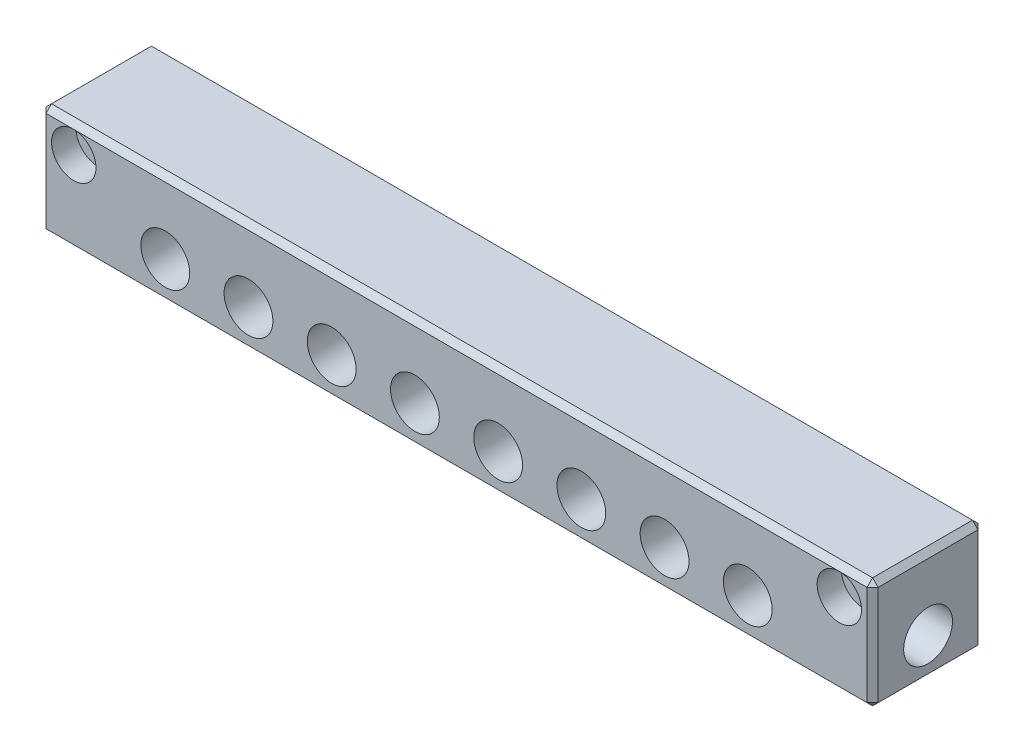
ISO-10303-21;
HEADER;
FILE_DESCRIPTION(('STEP AP214'),'2;1');
FILE_NAME('part.step','',(''),(''),'','','');
FILE_SCHEMA(('AUTOMOTIVE_DESIGN { 1 0 10303 214 1 1 1 1 }'));
ENDSEC;
DATA;
#1=APPLICATION_CONTEXT('core data for automotive mechanical design processes');
#2=APPLICATION_PROTOCOL_DEFINITION('international standard','automotive_design',2000,#1);
#3=PRODUCT_CONTEXT('',#1,'mechanical');
#4=PRODUCT('Part','Part','',(#3));
#5=PRODUCT_RELATED_PRODUCT_CATEGORY('part','',(#4));
#6=PRODUCT_DEFINITION_FORMATION('','',#4);
#7=PRODUCT_DEFINITION_CONTEXT('part definition',#1,'design');
#8=PRODUCT_DEFINITION('design','',#6,#7);
#9=PRODUCT_DEFINITION_SHAPE('','',#8);
#10=(LENGTH_UNIT() NAMED_UNIT(*) SI_UNIT(.MILLI.,.METRE.));
#11=(NAMED_UNIT(*) PLANE_ANGLE_UNIT() SI_UNIT($,.RADIAN.));
#12=(NAMED_UNIT(*) SI_UNIT($,.STERADIAN.) SOLID_ANGLE_UNIT());
#13=UNCERTAINTY_MEASURE_WITH_UNIT(LENGTH_MEASURE(1.E-05),#10,'distance_accuracy_value','');
#14=(GEOMETRIC_REPRESENTATION_CONTEXT(3) GLOBAL_UNCERTAINTY_ASSIGNED_CONTEXT((#13)) GLOBAL_UNIT_ASSIGNED_CONTEXT((#10,
#11,#12)) REPRESENTATION_CONTEXT('',''));
#15=CARTESIAN_POINT('',(0.,0.,0.));
#16=DIRECTION('',(0.,0.,1.));
#17=DIRECTION('',(1.,0.,0.));
#18=AXIS2_PLACEMENT_3D('',#15,#16,#17);
#19=CARTESIAN_POINT('',(52.5,-3.,10.));
#20=DIRECTION('',(0.,0.,1.));
#21=DIRECTION('',(1.,0.,0.));
#22=AXIS2_PLACEMENT_3D('',#19,#20,#21);
#23=CYLINDRICAL_SURFACE('',#22,4.39999999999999);
#24=CARTESIAN_POINT('',(52.5,-3.,10.));
#25=DIRECTION('',(0.,0.,1.));
#26=DIRECTION('',(1.,0.,0.));
#27=AXIS2_PLACEMENT_3D('',#24,#25,#26);
#28=CIRCLE('',#27,4.39999999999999);
#29=CARTESIAN_POINT('',(56.9,-3.,10.));
#30=VERTEX_POINT('',#29);
#31=EDGE_CURVE('E649',#30,#30,#28,.T.);
#32=ORIENTED_EDGE('',*,*,#31,.T.);
#33=EDGE_LOOP('',(#32));
#34=FACE_BOUND('',#33,.T.);
#35=CARTESIAN_POINT('',(52.5,-3.,0.));
#36=DIRECTION('',(-0.707106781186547,0.,0.707106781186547));
#37=DIRECTION('',(0.707106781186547,0.,0.707106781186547));
#38=AXIS2_PLACEMENT_3D('',#35,#36,#37);
#39=ELLIPSE('',#38,6.2225396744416,4.39999999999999);
#40=CARTESIAN_POINT('',(52.5,1.39999999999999,0.));
#41=VERTEX_POINT('',#40);
#42=CARTESIAN_POINT('',(52.5,-7.39999999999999,0.));
#43=VERTEX_POINT('',#42);
#44=EDGE_CURVE('E578',#41,#43,#39,.F.);
#45=ORIENTED_EDGE('',*,*,#44,.T.);
#46=CARTESIAN_POINT('',(52.5,-3.,0.));
#47=DIRECTION('',(0.707106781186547,0.,0.707106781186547));
#48=DIRECTION('',(-0.707106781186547,0.,0.707106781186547));
#49=AXIS2_PLACEMENT_3D('',#46,#47,#48);
#50=ELLIPSE('',#49,6.2225396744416,4.39999999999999);
#51=EDGE_CURVE('E589',#43,#41,#50,.F.);
#52=ORIENTED_EDGE('',*,*,#51,.T.);
#53=EDGE_LOOP('',(#45,#52));
#54=FACE_BOUND('',#53,.T.);
#55=ADVANCED_FACE('F56',(#34,#54),#23,.F.);
#56=CARTESIAN_POINT('',(22.5,-3.,10.));
#57=DIRECTION('',(0.,0.,1.));
#58=DIRECTION('',(1.,0.,0.));
#59=AXIS2_PLACEMENT_3D('',#56,#57,#58);
#60=CYLINDRICAL_SURFACE('',#59,4.39999999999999);
#61=CARTESIAN_POINT('',(22.5,-3.,10.));
#62=DIRECTION('',(0.,0.,1.));
#63=DIRECTION('',(1.,0.,0.));
#64=AXIS2_PLACEMENT_3D('',#61,#62,#63);
#65=CIRCLE('',#64,4.39999999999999);
#66=CARTESIAN_POINT('',(26.9,-3.,10.));
#67=VERTEX_POINT('',#66);
#68=EDGE_CURVE('E633',#67,#67,#65,.T.);
#69=ORIENTED_EDGE('',*,*,#68,.T.);
#70=EDGE_LOOP('',(#69));
#71=FACE_BOUND('',#70,.T.);
#72=CARTESIAN_POINT('',(22.5,-3.,0.));
#73=DIRECTION('',(-0.707106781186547,0.,0.707106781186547));
#74=DIRECTION('',(0.707106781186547,0.,0.707106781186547));
#75=AXIS2_PLACEMENT_3D('',#72,#73,#74);
#76=ELLIPSE('',#75,6.2225396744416,4.39999999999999);
#77=CARTESIAN_POINT('',(22.5,1.39999999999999,0.));
#78=VERTEX_POINT('',#77);
#79=CARTESIAN_POINT('',(22.5,-7.39999999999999,0.));
#80=VERTEX_POINT('',#79);
#81=EDGE_CURVE('E563',#78,#80,#76,.F.);
#82=ORIENTED_EDGE('',*,*,#81,.T.);
#83=CARTESIAN_POINT('',(22.5,-3.,0.));
#84=DIRECTION('',(0.707106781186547,0.,0.707106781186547));
#85=DIRECTION('',(-0.707106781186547,0.,0.707106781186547));
#86=AXIS2_PLACEMENT_3D('',#83,#84,#85);
#87=ELLIPSE('',#86,6.2225396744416,4.39999999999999);
#88=EDGE_CURVE('E574',#80,#78,#87,.F.);
#89=ORIENTED_EDGE('',*,*,#88,.T.);
#90=EDGE_LOOP('',(#82,#89));
#91=FACE_BOUND('',#90,.T.);
#92=ADVANCED_FACE('F752',(#71,#91),#60,.F.);
#93=CARTESIAN_POINT('',(37.5,-3.,10.));
#94=DIRECTION('',(0.,0.,1.));
#95=DIRECTION('',(1.,0.,0.));
#96=AXIS2_PLACEMENT_3D('',#93,#94,#95);
#97=CYLINDRICAL_SURFACE('',#96,4.39999999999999);
#98=CARTESIAN_POINT('',(37.5,-3.,10.));
#99=DIRECTION('',(0.,0.,1.));
#100=DIRECTION('',(1.,0.,0.));
#101=AXIS2_PLACEMENT_3D('',#98,#99,#100);
#102=CIRCLE('',#101,4.39999999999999);
#103=CARTESIAN_POINT('',(41.9,-3.,10.));
#104=VERTEX_POINT('',#103);
#105=EDGE_CURVE('E641',#104,#104,#102,.T.);
#106=ORIENTED_EDGE('',*,*,#105,.T.);
#107=EDGE_LOOP('',(#106));
#108=FACE_BOUND('',#107,.T.);
#109=CARTESIAN_POINT('',(37.5,-3.,0.));
#110=DIRECTION('',(-0.707106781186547,0.,0.707106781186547));
#111=DIRECTION('',(0.707106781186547,0.,0.707106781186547));
#112=AXIS2_PLACEMENT_3D('',#109,#110,#111);
#113=ELLIPSE('',#112,6.2225396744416,4.39999999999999);
#114=CARTESIAN_POINT('',(37.5,1.39999999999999,0.));
#115=VERTEX_POINT('',#114);
#116=CARTESIAN_POINT('',(37.5,-7.39999999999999,0.));
#117=VERTEX_POINT('',#116);
#118=EDGE_CURVE('E548',#115,#117,#113,.F.);
#119=ORIENTED_EDGE('',*,*,#118,.T.);
#120=CARTESIAN_POINT('',(37.5,-3.,0.));
#121=DIRECTION('',(0.707106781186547,0.,0.707106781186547));
#122=DIRECTION('',(-0.707106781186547,0.,0.707106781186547));
#123=AXIS2_PLACEMENT_3D('',#120,#121,#122);
#124=ELLIPSE('',#123,6.2225396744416,4.39999999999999);
#125=EDGE_CURVE('E559',#117,#115,#124,.F.);
#126=ORIENTED_EDGE('',*,*,#125,.T.);
#127=EDGE_LOOP('',(#119,#126));
#128=FACE_BOUND('',#127,.T.);
#129=ADVANCED_FACE('F759',(#108,#128),#97,.F.);
#130=CARTESIAN_POINT('',(-7.50000000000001,-3.,10.));
#131=DIRECTION('',(0.,0.,1.));
#132=DIRECTION('',(1.,0.,0.));
#133=AXIS2_PLACEMENT_3D('',#130,#131,#132);
#134=CYLINDRICAL_SURFACE('',#133,4.39999999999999);
#135=CARTESIAN_POINT('',(-7.50000000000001,-3.,10.));
#136=DIRECTION('',(0.,0.,1.));
#137=DIRECTION('',(1.,0.,0.));
#138=AXIS2_PLACEMENT_3D('',#135,#136,#137);
#139=CIRCLE('',#138,4.39999999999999);
#140=CARTESIAN_POINT('',(-3.10000000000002,-3.,10.));
#141=VERTEX_POINT('',#140);
#142=EDGE_CURVE('E617',#141,#141,#139,.T.);
#143=ORIENTED_EDGE('',*,*,#142,.T.);
#144=EDGE_LOOP('',(#143));
#145=FACE_BOUND('',#144,.T.);
#146=CARTESIAN_POINT('',(-7.50000000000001,-3.,0.));
#147=DIRECTION('',(-0.707106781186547,0.,0.707106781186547));
#148=DIRECTION('',(0.707106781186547,0.,0.707106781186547));
#149=AXIS2_PLACEMENT_3D('',#146,#147,#148);
#150=ELLIPSE('',#149,6.2225396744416,4.39999999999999);
#151=CARTESIAN_POINT('',(-7.50000000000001,1.39999999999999,0.));
#152=VERTEX_POINT('',#151);
#153=CARTESIAN_POINT('',(-7.50000000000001,-7.39999999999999,0.));
#154=VERTEX_POINT('',#153);
#155=EDGE_CURVE('E533',#152,#154,#150,.F.);
#156=ORIENTED_EDGE('',*,*,#155,.T.);
#157=CARTESIAN_POINT('',(-7.50000000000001,-3.,0.));
#158=DIRECTION('',(0.707106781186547,0.,0.707106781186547));
#159=DIRECTION('',(-0.707106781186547,0.,0.707106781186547));
#160=AXIS2_PLACEMENT_3D('',#157,#158,#159);
#161=ELLIPSE('',#160,6.2225396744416,4.39999999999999);
#162=EDGE_CURVE('E544',#154,#152,#161,.F.);
#163=ORIENTED_EDGE('',*,*,#162,.T.);
#164=EDGE_LOOP('',(#156,#163));
#165=FACE_BOUND('',#164,.T.);
#166=ADVANCED_FACE('F864',(#145,#165),#134,.F.);
#167=CARTESIAN_POINT('',(7.49999999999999,-3.,10.));
#168=DIRECTION('',(0.,0.,1.));
#169=DIRECTION('',(1.,0.,0.));
#170=AXIS2_PLACEMENT_3D('',#167,#168,#169);
#171=CYLINDRICAL_SURFACE('',#170,4.39999999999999);
#172=CARTESIAN_POINT('',(7.49999999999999,-3.,10.));
#173=DIRECTION('',(0.,0.,1.));
#174=DIRECTION('',(1.,0.,0.));
#175=AXIS2_PLACEMENT_3D('',#172,#173,#174);
#176=CIRCLE('',#175,4.39999999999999);
#177=CARTESIAN_POINT('',(11.9,-3.,10.));
#178=VERTEX_POINT('',#177);
#179=EDGE_CURVE('E625',#178,#178,#176,.T.);
#180=ORIENTED_EDGE('',*,*,#179,.T.);
#181=EDGE_LOOP('',(#180));
#182=FACE_BOUND('',#181,.T.);
#183=CARTESIAN_POINT('',(7.49999999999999,-3.,0.));
#184=DIRECTION('',(-0.707106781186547,0.,0.707106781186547));
#185=DIRECTION('',(0.707106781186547,0.,0.707106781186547));
#186=AXIS2_PLACEMENT_3D('',#183,#184,#185);
#187=ELLIPSE('',#186,6.2225396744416,4.39999999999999);
#188=CARTESIAN_POINT('',(7.49999999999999,1.39999999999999,0.));
#189=VERTEX_POINT('',#188);
#190=CARTESIAN_POINT('',(7.49999999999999,-7.39999999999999,0.));
#191=VERTEX_POINT('',#190);
#192=EDGE_CURVE('E518',#189,#191,#187,.F.);
#193=ORIENTED_EDGE('',*,*,#192,.T.);
#194=CARTESIAN_POINT('',(7.49999999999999,-3.,0.));
#195=DIRECTION('',(0.707106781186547,0.,0.707106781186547));
#196=DIRECTION('',(-0.707106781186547,0.,0.707106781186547));
#197=AXIS2_PLACEMENT_3D('',#194,#195,#196);
#198=ELLIPSE('',#197,6.2225396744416,4.39999999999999);
#199=EDGE_CURVE('E529',#191,#189,#198,.F.);
#200=ORIENTED_EDGE('',*,*,#199,.T.);
#201=EDGE_LOOP('',(#193,#200));
#202=FACE_BOUND('',#201,.T.);
#203=ADVANCED_FACE('F869',(#182,#202),#171,.F.);
#204=CARTESIAN_POINT('',(-37.5,-3.,10.));
#205=DIRECTION('',(0.,0.,1.));
#206=DIRECTION('',(1.,0.,0.));
#207=AXIS2_PLACEMENT_3D('',#204,#205,#206);
#208=CYLINDRICAL_SURFACE('',#207,4.39999999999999);
#209=CARTESIAN_POINT('',(-37.5,-3.,10.));
#210=DIRECTION('',(0.,0.,1.));
#211=DIRECTION('',(1.,0.,0.));
#212=AXIS2_PLACEMENT_3D('',#209,#210,#211);
#213=CIRCLE('',#212,4.39999999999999);
#214=CARTESIAN_POINT('',(-33.1,-3.,10.));
#215=VERTEX_POINT('',#214);
#216=EDGE_CURVE('E601',#215,#215,#213,.T.);
#217=ORIENTED_EDGE('',*,*,#216,.T.);
#218=EDGE_LOOP('',(#217));
#219=FACE_BOUND('',#218,.T.);
#220=CARTESIAN_POINT('',(-37.5,-3.,0.));
#221=DIRECTION('',(-0.707106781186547,0.,0.707106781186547));
#222=DIRECTION('',(0.707106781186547,0.,0.707106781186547));
#223=AXIS2_PLACEMENT_3D('',#220,#221,#222);
#224=ELLIPSE('',#223,6.2225396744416,4.39999999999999);
#225=CARTESIAN_POINT('',(-37.5,1.39999999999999,0.));
#226=VERTEX_POINT('',#225);
#227=CARTESIAN_POINT('',(-37.5,-7.39999999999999,0.));
#228=VERTEX_POINT('',#227);
#229=EDGE_CURVE('E254',#226,#228,#224,.F.);
#230=ORIENTED_EDGE('',*,*,#229,.T.);
#231=CARTESIAN_POINT('',(-37.5,-3.,0.));
#232=DIRECTION('',(0.707106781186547,0.,0.707106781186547));
#233=DIRECTION('',(-0.707106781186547,0.,0.707106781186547));
#234=AXIS2_PLACEMENT_3D('',#231,#232,#233);
#235=ELLIPSE('',#234,6.2225396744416,4.39999999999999);
#236=EDGE_CURVE('E514',#228,#226,#235,.F.);
#237=ORIENTED_EDGE('',*,*,#236,.T.);
#238=EDGE_LOOP('',(#230,#237));
#239=FACE_BOUND('',#238,.T.);
#240=ADVANCED_FACE('F810',(#219,#239),#208,.F.);
#241=CARTESIAN_POINT('',(-22.5,-3.,10.));
#242=DIRECTION('',(0.,0.,1.));
#243=DIRECTION('',(1.,0.,0.));
#244=AXIS2_PLACEMENT_3D('',#241,#242,#243);
#245=CYLINDRICAL_SURFACE('',#244,4.39999999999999);
#246=CARTESIAN_POINT('',(-22.5,-3.,10.));
#247=DIRECTION('',(0.,0.,1.));
#248=DIRECTION('',(1.,0.,0.));
#249=AXIS2_PLACEMENT_3D('',#246,#247,#248);
#250=CIRCLE('',#249,4.39999999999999);
#251=CARTESIAN_POINT('',(-18.1,-3.,10.));
#252=VERTEX_POINT('',#251);
#253=EDGE_CURVE('E609',#252,#252,#250,.T.);
#254=ORIENTED_EDGE('',*,*,#253,.T.);
#255=EDGE_LOOP('',(#254));
#256=FACE_BOUND('',#255,.T.);
#257=CARTESIAN_POINT('',(-22.5,-3.,0.));
#258=DIRECTION('',(-0.707106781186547,0.,0.707106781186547));
#259=DIRECTION('',(0.707106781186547,0.,0.707106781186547));
#260=AXIS2_PLACEMENT_3D('',#257,#258,#259);
#261=ELLIPSE('',#260,6.2225396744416,4.39999999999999);
#262=CARTESIAN_POINT('',(-22.5,1.39999999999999,0.));
#263=VERTEX_POINT('',#262);
#264=CARTESIAN_POINT('',(-22.5,-7.39999999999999,0.));
#265=VERTEX_POINT('',#264);
#266=EDGE_CURVE('E304',#263,#265,#261,.F.);
#267=ORIENTED_EDGE('',*,*,#266,.T.);
#268=CARTESIAN_POINT('',(-22.5,-3.,0.));
#269=DIRECTION('',(0.707106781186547,0.,0.707106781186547));
#270=DIRECTION('',(-0.707106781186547,0.,0.707106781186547));
#271=AXIS2_PLACEMENT_3D('',#268,#269,#270);
#272=ELLIPSE('',#271,6.2225396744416,4.39999999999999);
#273=EDGE_CURVE('E315',#265,#263,#272,.F.);
#274=ORIENTED_EDGE('',*,*,#273,.T.);
#275=EDGE_LOOP('',(#267,#274));
#276=FACE_BOUND('',#275,.T.);
#277=ADVANCED_FACE('F836',(#256,#276),#245,.F.);
#278=CARTESIAN_POINT('',(75.,10.,10.));
#279=DIRECTION('',(-1.,0.,0.));
#280=DIRECTION('',(0.,0.,1.));
#281=AXIS2_PLACEMENT_3D('',#278,#279,#280);
#282=PLANE('',#281);
#283=DIRECTION('',(0.,1.,0.));
#284=VECTOR('',#283,1.);
#285=CARTESIAN_POINT('',(75.,10.,-9.00000000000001));
#286=LINE('',#285,#284);
#287=CARTESIAN_POINT('',(75.,-9.00000000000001,-9.00000000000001));
#288=VERTEX_POINT('',#287);
#289=CARTESIAN_POINT('',(75.,9.00000000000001,-9.00000000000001));
#290=VERTEX_POINT('',#289);
#291=EDGE_CURVE('E332',#288,#290,#286,.T.);
#292=ORIENTED_EDGE('',*,*,#291,.T.);
#293=DIRECTION('',(0.,0.,1.));
#294=VECTOR('',#293,1.);
#295=CARTESIAN_POINT('',(75.,9.00000000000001,10.));
#296=LINE('',#295,#294);
#297=CARTESIAN_POINT('',(75.,9.00000000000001,9.00000000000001));
#298=VERTEX_POINT('',#297);
#299=EDGE_CURVE('E341',#290,#298,#296,.T.);
#300=ORIENTED_EDGE('',*,*,#299,.T.);
#301=DIRECTION('',(0.,-1.,0.));
#302=VECTOR('',#301,1.);
#303=CARTESIAN_POINT('',(75.,-10.,9.00000000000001));
#304=LINE('',#303,#302);
#305=CARTESIAN_POINT('',(75.,-9.00000000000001,9.00000000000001));
#306=VERTEX_POINT('',#305);
#307=EDGE_CURVE('E338',#298,#306,#304,.T.);
#308=ORIENTED_EDGE('',*,*,#307,.T.);
#309=DIRECTION('',(0.,0.,-1.));
#310=VECTOR('',#309,1.);
#311=CARTESIAN_POINT('',(75.,-9.00000000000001,10.));
#312=LINE('',#311,#310);
#313=EDGE_CURVE('E335',#306,#288,#312,.T.);
#314=ORIENTED_EDGE('',*,*,#313,.T.);
#315=EDGE_LOOP('',(#292,#300,#308,#314));
#316=FACE_BOUND('',#315,.T.);
#317=CARTESIAN_POINT('',(75.,-3.,0.));
#318=DIRECTION('',(1.,0.,0.));
#319=DIRECTION('',(0.,0.,-1.));
#320=AXIS2_PLACEMENT_3D('',#317,#318,#319);
#321=CIRCLE('',#320,4.39999999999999);
#322=CARTESIAN_POINT('',(75.,-3.,-4.39999999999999));
#323=VERTEX_POINT('',#322);
#324=EDGE_CURVE('E490',#323,#323,#321,.T.);
#325=ORIENTED_EDGE('',*,*,#324,.F.);
#326=EDGE_LOOP('',(#325));
#327=FACE_BOUND('',#326,.T.);
#328=ADVANCED_FACE('F1081',(#316,#327),#282,.F.);
#329=CARTESIAN_POINT('',(-75.,10.,10.));
#330=DIRECTION('',(0.,-1.,0.));
#331=DIRECTION('',(0.,0.,-1.));
#332=AXIS2_PLACEMENT_3D('',#329,#330,#331);
#333=PLANE('',#332);
#334=DIRECTION('',(1.,0.,0.));
#335=VECTOR('',#334,1.);
#336=CARTESIAN_POINT('',(75.,10.,9.));
#337=LINE('',#336,#335);
#338=CARTESIAN_POINT('',(-74.,10.,9.));
#339=VERTEX_POINT('',#338);
#340=CARTESIAN_POINT('',(74.,10.,9.));
#341=VERTEX_POINT('',#340);
#342=EDGE_CURVE('E325',#339,#341,#337,.T.);
#343=ORIENTED_EDGE('',*,*,#342,.T.);
#344=DIRECTION('',(0.,0.,-1.));
#345=VECTOR('',#344,1.);
#346=CARTESIAN_POINT('',(74.,10.,10.));
#347=LINE('',#346,#345);
#348=CARTESIAN_POINT('',(74.,10.,-9.00000000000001));
#349=VERTEX_POINT('',#348);
#350=EDGE_CURVE('E328',#341,#349,#347,.T.);
#351=ORIENTED_EDGE('',*,*,#350,.T.);
#352=DIRECTION('',(-1.,0.,0.));
#353=VECTOR('',#352,1.);
#354=CARTESIAN_POINT('',(-75.,10.,-9.00000000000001));
#355=LINE('',#354,#353);
#356=CARTESIAN_POINT('',(-74.,10.,-9.00000000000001));
#357=VERTEX_POINT('',#356);
#358=EDGE_CURVE('E319',#349,#357,#355,.T.);
#359=ORIENTED_EDGE('',*,*,#358,.T.);
#360=DIRECTION('',(0.,0.,1.));
#361=VECTOR('',#360,1.);
#362=CARTESIAN_POINT('',(-74.,10.,10.));
#363=LINE('',#362,#361);
#364=EDGE_CURVE('E322',#357,#339,#363,.T.);
#365=ORIENTED_EDGE('',*,*,#364,.T.);
#366=EDGE_LOOP('',(#343,#351,#359,#365));
#367=FACE_BOUND('',#366,.T.);
#368=ADVANCED_FACE('F722',(#367),#333,.F.);
#369=CARTESIAN_POINT('',(-75.,10.,10.));
#370=DIRECTION('',(1.,0.,0.));
#371=DIRECTION('',(0.,0.,-1.));
#372=AXIS2_PLACEMENT_3D('',#369,#370,#371);
#373=PLANE('',#372);
#374=DIRECTION('',(0.,0.,1.));
#375=VECTOR('',#374,1.);
#376=CARTESIAN_POINT('',(-75.,-9.,10.));
#377=LINE('',#376,#375);
#378=CARTESIAN_POINT('',(-75.,-9.,-9.00000000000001));
#379=VERTEX_POINT('',#378);
#380=CARTESIAN_POINT('',(-75.,-9.,9.));
#381=VERTEX_POINT('',#380);
#382=EDGE_CURVE('E367',#379,#381,#377,.T.);
#383=ORIENTED_EDGE('',*,*,#382,.T.);
#384=DIRECTION('',(0.,1.,0.));
#385=VECTOR('',#384,1.);
#386=CARTESIAN_POINT('',(-75.,10.,9.));
#387=LINE('',#386,#385);
#388=CARTESIAN_POINT('',(-75.,9.00000000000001,9.));
#389=VERTEX_POINT('',#388);
#390=EDGE_CURVE('E374',#381,#389,#387,.T.);
#391=ORIENTED_EDGE('',*,*,#390,.T.);
#392=DIRECTION('',(0.,0.,-1.));
#393=VECTOR('',#392,1.);
#394=CARTESIAN_POINT('',(-75.,9.00000000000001,10.));
#395=LINE('',#394,#393);
#396=CARTESIAN_POINT('',(-75.,9.00000000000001,-9.00000000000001));
#397=VERTEX_POINT('',#396);
#398=EDGE_CURVE('E370',#389,#397,#395,.T.);
#399=ORIENTED_EDGE('',*,*,#398,.T.);
#400=DIRECTION('',(0.,-1.,0.));
#401=VECTOR('',#400,1.);
#402=CARTESIAN_POINT('',(-75.,10.,-9.00000000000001));
#403=LINE('',#402,#401);
#404=EDGE_CURVE('E364',#397,#379,#403,.T.);
#405=ORIENTED_EDGE('',*,*,#404,.T.);
#406=EDGE_LOOP('',(#383,#391,#399,#405));
#407=FACE_BOUND('',#406,.T.);
#408=ADVANCED_FACE('F1216',(#407),#373,.F.);
#409=CARTESIAN_POINT('',(-75.,-10.,10.));
#410=DIRECTION('',(0.,1.,0.));
#411=DIRECTION('',(0.,0.,1.));
#412=AXIS2_PLACEMENT_3D('',#409,#410,#411);
#413=PLANE('',#412);
#414=DIRECTION('',(-1.,0.,0.));
#415=VECTOR('',#414,1.);
#416=CARTESIAN_POINT('',(-75.,-10.,9.));
#417=LINE('',#416,#415);
#418=CARTESIAN_POINT('',(74.,-10.,9.));
#419=VERTEX_POINT('',#418);
#420=CARTESIAN_POINT('',(-74.,-10.,9.));
#421=VERTEX_POINT('',#420);
#422=EDGE_CURVE('E67',#419,#421,#417,.T.);
#423=ORIENTED_EDGE('',*,*,#422,.T.);
#424=DIRECTION('',(0.,0.,-1.));
#425=VECTOR('',#424,1.);
#426=CARTESIAN_POINT('',(-74.,-10.,10.));
#427=LINE('',#426,#425);
#428=CARTESIAN_POINT('',(-74.,-10.,-9.00000000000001));
#429=VERTEX_POINT('',#428);
#430=EDGE_CURVE('E13',#421,#429,#427,.T.);
#431=ORIENTED_EDGE('',*,*,#430,.T.);
#432=DIRECTION('',(1.,0.,0.));
#433=VECTOR('',#432,1.);
#434=CARTESIAN_POINT('',(-75.,-10.,-9.00000000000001));
#435=LINE('',#434,#433);
#436=CARTESIAN_POINT('',(74.,-10.,-9.00000000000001));
#437=VERTEX_POINT('',#436);
#438=EDGE_CURVE('E390',#429,#437,#435,.T.);
#439=ORIENTED_EDGE('',*,*,#438,.T.);
#440=DIRECTION('',(0.,0.,1.));
#441=VECTOR('',#440,1.);
#442=CARTESIAN_POINT('',(74.,-10.,10.));
#443=LINE('',#442,#441);
#444=EDGE_CURVE('E78',#437,#419,#443,.T.);
#445=ORIENTED_EDGE('',*,*,#444,.T.);
#446=EDGE_LOOP('',(#423,#431,#439,#445));
#447=FACE_BOUND('',#446,.T.);
#448=ADVANCED_FACE('F1226',(#447),#413,.F.);
#449=CARTESIAN_POINT('',(0.,0.,10.));
#450=DIRECTION('',(0.,0.,1.));
#451=DIRECTION('',(1.,0.,0.));
#452=AXIS2_PLACEMENT_3D('',#449,#450,#451);
#453=PLANE('',#452);
#454=CARTESIAN_POINT('',(-52.5,-3.,10.));
#455=DIRECTION('',(0.,0.,1.));
#456=DIRECTION('',(1.,0.,0.));
#457=AXIS2_PLACEMENT_3D('',#454,#455,#456);
#458=CIRCLE('',#457,4.39999999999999);
#459=CARTESIAN_POINT('',(-48.1,-3.,10.));
#460=VERTEX_POINT('',#459);
#461=EDGE_CURVE('E593',#460,#460,#458,.T.);
#462=ORIENTED_EDGE('',*,*,#461,.F.);
#463=EDGE_LOOP('',(#462));
#464=FACE_BOUND('',#463,.T.);
#465=ORIENTED_EDGE('',*,*,#216,.F.);
#466=EDGE_LOOP('',(#465));
#467=FACE_BOUND('',#466,.T.);
#468=ORIENTED_EDGE('',*,*,#253,.F.);
#469=EDGE_LOOP('',(#468));
#470=FACE_BOUND('',#469,.T.);
#471=ORIENTED_EDGE('',*,*,#142,.F.);
#472=EDGE_LOOP('',(#471));
#473=FACE_BOUND('',#472,.T.);
#474=ORIENTED_EDGE('',*,*,#179,.F.);
#475=EDGE_LOOP('',(#474));
#476=FACE_BOUND('',#475,.T.);
#477=ORIENTED_EDGE('',*,*,#68,.F.);
#478=EDGE_LOOP('',(#477));
#479=FACE_BOUND('',#478,.T.);
#480=ORIENTED_EDGE('',*,*,#105,.F.);
#481=EDGE_LOOP('',(#480));
#482=FACE_BOUND('',#481,.T.);
#483=ORIENTED_EDGE('',*,*,#31,.F.);
#484=EDGE_LOOP('',(#483));
#485=FACE_BOUND('',#484,.T.);
#486=DIRECTION('',(0.,1.,0.));
#487=VECTOR('',#486,1.);
#488=CARTESIAN_POINT('',(74.,10.,10.));
#489=LINE('',#488,#487);
#490=CARTESIAN_POINT('',(74.,-9.00000000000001,10.));
#491=VERTEX_POINT('',#490);
#492=CARTESIAN_POINT('',(74.,9.00000000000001,10.));
#493=VERTEX_POINT('',#492);
#494=EDGE_CURVE('E345',#491,#493,#489,.T.);
#495=ORIENTED_EDGE('',*,*,#494,.T.);
#496=DIRECTION('',(-1.,0.,0.));
#497=VECTOR('',#496,1.);
#498=CARTESIAN_POINT('',(-75.,9.00000000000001,10.));
#499=LINE('',#498,#497);
#500=CARTESIAN_POINT('',(69.,9.00000000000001,10.));
#501=VERTEX_POINT('',#500);
#502=EDGE_CURVE('E360',#493,#501,#499,.T.);
#503=ORIENTED_EDGE('',*,*,#502,.T.);
#504=CARTESIAN_POINT('',(69.,5.,10.));
#505=DIRECTION('',(0.,0.,1.));
#506=DIRECTION('',(1.,0.,0.));
#507=AXIS2_PLACEMENT_3D('',#504,#505,#506);
#508=CIRCLE('',#507,4.);
#509=EDGE_CURVE('E673',#501,#501,#508,.T.);
#510=ORIENTED_EDGE('',*,*,#509,.F.);
#511=DIRECTION('',(-1.,0.,0.));
#512=VECTOR('',#511,1.);
#513=CARTESIAN_POINT('',(-75.,9.00000000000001,10.));
#514=LINE('',#513,#512);
#515=CARTESIAN_POINT('',(-69.,9.00000000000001,10.));
#516=VERTEX_POINT('',#515);
#517=EDGE_CURVE('E357',#501,#516,#514,.T.);
#518=ORIENTED_EDGE('',*,*,#517,.T.);
#519=CARTESIAN_POINT('',(-69.,5.,10.));
#520=DIRECTION('',(0.,0.,1.));
#521=DIRECTION('',(1.,0.,0.));
#522=AXIS2_PLACEMENT_3D('',#519,#520,#521);
#523=CIRCLE('',#522,4.);
#524=EDGE_CURVE('E657',#516,#516,#523,.T.);
#525=ORIENTED_EDGE('',*,*,#524,.F.);
#526=DIRECTION('',(-1.,0.,0.));
#527=VECTOR('',#526,1.);
#528=CARTESIAN_POINT('',(-75.,9.00000000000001,10.));
#529=LINE('',#528,#527);
#530=CARTESIAN_POINT('',(-74.,9.00000000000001,10.));
#531=VERTEX_POINT('',#530);
#532=EDGE_CURVE('E354',#516,#531,#529,.T.);
#533=ORIENTED_EDGE('',*,*,#532,.T.);
#534=DIRECTION('',(0.,-1.,0.));
#535=VECTOR('',#534,1.);
#536=CARTESIAN_POINT('',(-74.,-10.,10.));
#537=LINE('',#536,#535);
#538=CARTESIAN_POINT('',(-74.,-9.00000000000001,10.));
#539=VERTEX_POINT('',#538);
#540=EDGE_CURVE('E351',#531,#539,#537,.T.);
#541=ORIENTED_EDGE('',*,*,#540,.T.);
#542=DIRECTION('',(1.,0.,0.));
#543=VECTOR('',#542,1.);
#544=CARTESIAN_POINT('',(75.,-9.00000000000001,10.));
#545=LINE('',#544,#543);
#546=EDGE_CURVE('E348',#539,#491,#545,.T.);
#547=ORIENTED_EDGE('',*,*,#546,.T.);
#548=EDGE_LOOP('',(#495,#503,#510,#518,#525,#533,#541,#547));
#549=FACE_BOUND('',#548,.T.);
#550=ADVANCED_FACE('F700',(#464,#467,#470,#473,#476,#479,#482,#485,#549),#453,.T.);
#551=CARTESIAN_POINT('',(0.,0.,-10.));
#552=DIRECTION('',(0.,0.,1.));
#553=DIRECTION('',(1.,0.,0.));
#554=AXIS2_PLACEMENT_3D('',#551,#552,#553);
#555=PLANE('',#554);
#556=DIRECTION('',(0.,1.,0.));
#557=VECTOR('',#556,1.);
#558=CARTESIAN_POINT('',(-74.,0.,-10.));
#559=LINE('',#558,#557);
#560=CARTESIAN_POINT('',(-74.,-9.,-10.));
#561=VERTEX_POINT('',#560);
#562=CARTESIAN_POINT('',(-74.,9.,-10.));
#563=VERTEX_POINT('',#562);
#564=EDGE_CURVE('E383',#561,#563,#559,.T.);
#565=ORIENTED_EDGE('',*,*,#564,.T.);
#566=DIRECTION('',(1.,0.,0.));
#567=VECTOR('',#566,1.);
#568=CARTESIAN_POINT('',(0.,9.,-10.));
#569=LINE('',#568,#567);
#570=CARTESIAN_POINT('',(74.,9.,-10.));
#571=VERTEX_POINT('',#570);
#572=EDGE_CURVE('E386',#563,#571,#569,.T.);
#573=ORIENTED_EDGE('',*,*,#572,.T.);
#574=DIRECTION('',(0.,-1.,0.));
#575=VECTOR('',#574,1.);
#576=CARTESIAN_POINT('',(74.,0.,-10.));
#577=LINE('',#576,#575);
#578=CARTESIAN_POINT('',(74.,-9.,-10.));
#579=VERTEX_POINT('',#578);
#580=EDGE_CURVE('E377',#571,#579,#577,.T.);
#581=ORIENTED_EDGE('',*,*,#580,.T.);
#582=DIRECTION('',(-1.,0.,0.));
#583=VECTOR('',#582,1.);
#584=CARTESIAN_POINT('',(0.,-9.,-10.));
#585=LINE('',#584,#583);
#586=EDGE_CURVE('E380',#579,#561,#585,.T.);
#587=ORIENTED_EDGE('',*,*,#586,.T.);
#588=EDGE_LOOP('',(#565,#573,#581,#587));
#589=FACE_BOUND('',#588,.T.);
#590=CARTESIAN_POINT('',(-69.,5.,-10.));
#591=DIRECTION('',(0.,0.,1.));
#592=DIRECTION('',(1.,0.,0.));
#593=AXIS2_PLACEMENT_3D('',#590,#591,#592);
#594=CIRCLE('',#593,2.25);
#595=CARTESIAN_POINT('',(-66.75,5.,-10.));
#596=VERTEX_POINT('',#595);
#597=EDGE_CURVE('E669',#596,#596,#594,.T.);
#598=ORIENTED_EDGE('',*,*,#597,.T.);
#599=EDGE_LOOP('',(#598));
#600=FACE_BOUND('',#599,.T.);
#601=CARTESIAN_POINT('',(69.,5.,-10.));
#602=DIRECTION('',(0.,0.,1.));
#603=DIRECTION('',(1.,0.,0.));
#604=AXIS2_PLACEMENT_3D('',#601,#602,#603);
#605=CIRCLE('',#604,2.25);
#606=CARTESIAN_POINT('',(71.25,5.,-10.));
#607=VERTEX_POINT('',#606);
#608=EDGE_CURVE('E272',#607,#607,#605,.T.);
#609=ORIENTED_EDGE('',*,*,#608,.T.);
#610=EDGE_LOOP('',(#609));
#611=FACE_BOUND('',#610,.T.);
#612=ADVANCED_FACE('F1246',(#589,#600,#611),#555,.F.);
#613=CARTESIAN_POINT('',(69.,5.,10.));
#614=DIRECTION('',(0.,0.,1.));
#615=DIRECTION('',(1.,0.,0.));
#616=AXIS2_PLACEMENT_3D('',#613,#614,#615);
#617=CYLINDRICAL_SURFACE('',#616,2.25);
#618=ORIENTED_EDGE('',*,*,#608,.F.);
#619=EDGE_LOOP('',(#618));
#620=FACE_BOUND('',#619,.T.);
#621=CARTESIAN_POINT('',(69.,5.,5.6));
#622=DIRECTION('',(0.,0.,1.));
#623=DIRECTION('',(1.,0.,0.));
#624=AXIS2_PLACEMENT_3D('',#621,#622,#623);
#625=CIRCLE('',#624,2.25);
#626=CARTESIAN_POINT('',(71.25,5.,5.6));
#627=VERTEX_POINT('',#626);
#628=EDGE_CURVE('E277',#627,#627,#625,.T.);
#629=ORIENTED_EDGE('',*,*,#628,.T.);
#630=EDGE_LOOP('',(#629));
#631=FACE_BOUND('',#630,.T.);
#632=ADVANCED_FACE('F685',(#620,#631),#617,.F.);
#633=CARTESIAN_POINT('',(71.25,5.,5.6));
#634=DIRECTION('',(0.,0.,-1.));
#635=DIRECTION('',(-1.,0.,0.));
#636=AXIS2_PLACEMENT_3D('',#633,#634,#635);
#637=PLANE('',#636);
#638=ORIENTED_EDGE('',*,*,#628,.F.);
#639=EDGE_LOOP('',(#638));
#640=FACE_BOUND('',#639,.T.);
#641=CARTESIAN_POINT('',(69.,5.,5.6));
#642=DIRECTION('',(0.,0.,1.));
#643=DIRECTION('',(1.,0.,0.));
#644=AXIS2_PLACEMENT_3D('',#641,#642,#643);
#645=CIRCLE('',#644,4.);
#646=CARTESIAN_POINT('',(73.,5.,5.6));
#647=VERTEX_POINT('',#646);
#648=EDGE_CURVE('E677',#647,#647,#645,.T.);
#649=ORIENTED_EDGE('',*,*,#648,.T.);
#650=EDGE_LOOP('',(#649));
#651=FACE_BOUND('',#650,.T.);
#652=ADVANCED_FACE('F687',(#640,#651),#637,.F.);
#653=CARTESIAN_POINT('',(69.,5.,10.));
#654=DIRECTION('',(0.,0.,1.));
#655=DIRECTION('',(1.,0.,0.));
#656=AXIS2_PLACEMENT_3D('',#653,#654,#655);
#657=CYLINDRICAL_SURFACE('',#656,4.);
#658=ORIENTED_EDGE('',*,*,#648,.F.);
#659=EDGE_LOOP('',(#658));
#660=FACE_BOUND('',#659,.T.);
#661=ORIENTED_EDGE('',*,*,#509,.T.);
#662=EDGE_LOOP('',(#661));
#663=FACE_BOUND('',#662,.T.);
#664=ADVANCED_FACE('F690',(#660,#663),#657,.F.);
#665=CARTESIAN_POINT('',(-69.,5.,10.));
#666=DIRECTION('',(0.,0.,1.));
#667=DIRECTION('',(1.,0.,0.));
#668=AXIS2_PLACEMENT_3D('',#665,#666,#667);
#669=CYLINDRICAL_SURFACE('',#668,2.25);
#670=ORIENTED_EDGE('',*,*,#597,.F.);
#671=EDGE_LOOP('',(#670));
#672=FACE_BOUND('',#671,.T.);
#673=CARTESIAN_POINT('',(-69.,5.,5.6));
#674=DIRECTION('',(0.,0.,1.));
#675=DIRECTION('',(1.,0.,0.));
#676=AXIS2_PLACEMENT_3D('',#673,#674,#675);
#677=CIRCLE('',#676,2.25);
#678=CARTESIAN_POINT('',(-66.75,5.,5.6));
#679=VERTEX_POINT('',#678);
#680=EDGE_CURVE('E665',#679,#679,#677,.T.);
#681=ORIENTED_EDGE('',*,*,#680,.T.);
#682=EDGE_LOOP('',(#681));
#683=FACE_BOUND('',#682,.T.);
#684=ADVANCED_FACE('F696',(#672,#683),#669,.F.);
#685=CARTESIAN_POINT('',(-66.75,5.,5.6));
#686=DIRECTION('',(0.,0.,-1.));
#687=DIRECTION('',(-1.,0.,0.));
#688=AXIS2_PLACEMENT_3D('',#685,#686,#687);
#689=PLANE('',#688);
#690=ORIENTED_EDGE('',*,*,#680,.F.);
#691=EDGE_LOOP('',(#690));
#692=FACE_BOUND('',#691,.T.);
#693=CARTESIAN_POINT('',(-69.,5.,5.6));
#694=DIRECTION('',(0.,0.,1.));
#695=DIRECTION('',(1.,0.,0.));
#696=AXIS2_PLACEMENT_3D('',#693,#694,#695);
#697=CIRCLE('',#696,4.);
#698=CARTESIAN_POINT('',(-65.,5.,5.6));
#699=VERTEX_POINT('',#698);
#700=EDGE_CURVE('E661',#699,#699,#697,.T.);
#701=ORIENTED_EDGE('',*,*,#700,.T.);
#702=EDGE_LOOP('',(#701));
#703=FACE_BOUND('',#702,.T.);
#704=ADVANCED_FACE('F739',(#692,#703),#689,.F.);
#705=CARTESIAN_POINT('',(-69.,5.,10.));
#706=DIRECTION('',(0.,0.,1.));
#707=DIRECTION('',(1.,0.,0.));
#708=AXIS2_PLACEMENT_3D('',#705,#706,#707);
#709=CYLINDRICAL_SURFACE('',#708,4.);
#710=ORIENTED_EDGE('',*,*,#700,.F.);
#711=EDGE_LOOP('',(#710));
#712=FACE_BOUND('',#711,.T.);
#713=ORIENTED_EDGE('',*,*,#524,.T.);
#714=EDGE_LOOP('',(#713));
#715=FACE_BOUND('',#714,.T.);
#716=ADVANCED_FACE('F737',(#712,#715),#709,.F.);
#717=CARTESIAN_POINT('',(-52.5,-3.,10.));
#718=DIRECTION('',(0.,0.,1.));
#719=DIRECTION('',(1.,0.,0.));
#720=AXIS2_PLACEMENT_3D('',#717,#718,#719);
#721=CYLINDRICAL_SURFACE('',#720,4.39999999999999);
#722=CARTESIAN_POINT('',(-52.5,-3.,0.));
#723=DIRECTION('',(0.707106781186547,0.,0.707106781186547));
#724=DIRECTION('',(-0.707106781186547,0.,0.707106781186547));
#725=AXIS2_PLACEMENT_3D('',#722,#723,#724);
#726=ELLIPSE('',#725,6.2225396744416,4.39999999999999);
#727=CARTESIAN_POINT('',(-55.,0.620773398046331,2.49999999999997));
#728=VERTEX_POINT('',#727);
#729=CARTESIAN_POINT('',(-52.5,1.39999999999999,0.));
#730=VERTEX_POINT('',#729);
#731=EDGE_CURVE('E258',#728,#730,#726,.F.);
#732=ORIENTED_EDGE('',*,*,#731,.T.);
#733=CARTESIAN_POINT('',(-52.5,-3.,0.));
#734=DIRECTION('',(-0.707106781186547,0.,0.707106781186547));
#735=DIRECTION('',(0.707106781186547,0.,0.707106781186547));
#736=AXIS2_PLACEMENT_3D('',#733,#734,#735);
#737=ELLIPSE('',#736,6.2225396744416,4.39999999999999);
#738=CARTESIAN_POINT('',(-52.5,-7.39999999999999,0.));
#739=VERTEX_POINT('',#738);
#740=EDGE_CURVE('E1694',#730,#739,#737,.F.);
#741=ORIENTED_EDGE('',*,*,#740,.T.);
#742=CARTESIAN_POINT('',(-55.,-6.62077339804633,2.49999999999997));
#743=VERTEX_POINT('',#742);
#744=EDGE_CURVE('E266',#739,#743,#726,.F.);
#745=ORIENTED_EDGE('',*,*,#744,.T.);
#746=CARTESIAN_POINT('',(-54.8098,-6.74497315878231,2.86722545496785));
#747=CARTESIAN_POINT('',(-54.8603860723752,-6.71376760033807,2.76948968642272));
#748=CARTESIAN_POINT('',(-54.9108214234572,-6.68125056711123,2.67208841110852));
#749=CARTESIAN_POINT('',(-55.0113778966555,-6.61340184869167,2.47802773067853));
#750=CARTESIAN_POINT('',(-55.0614988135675,-6.57806849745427,2.38136880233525));
#751=CARTESIAN_POINT('',(-55.1621333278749,-6.50385695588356,2.18747952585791));
#752=CARTESIAN_POINT('',(-55.2126408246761,-6.4649320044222,2.09026384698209));
#753=CARTESIAN_POINT('',(-55.3131861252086,-6.38380777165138,1.89702080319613));
#754=CARTESIAN_POINT('',(-55.3632241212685,-6.34160990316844,1.80099294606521));
#755=CARTESIAN_POINT('',(-55.4686137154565,-6.24851365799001,1.59919712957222));
#756=CARTESIAN_POINT('',(-55.5239044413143,-6.19717453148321,1.49359931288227));
#757=CARTESIAN_POINT('',(-55.6339039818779,-6.08942991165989,1.28450745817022));
#758=CARTESIAN_POINT('',(-55.6886120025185,-6.03301830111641,1.18101614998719));
#759=CARTESIAN_POINT('',(-55.7970295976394,-5.91479246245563,0.977806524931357));
#760=CARTESIAN_POINT('',(-55.8507435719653,-5.85302154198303,0.878065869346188));
#761=CARTESIAN_POINT('',(-55.9312506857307,-5.75468606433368,0.732420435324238));
#762=CARTESIAN_POINT('',(-55.9580506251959,-5.72099533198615,0.68457593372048));
#763=CARTESIAN_POINT('',(-56.0118788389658,-5.6511628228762,0.590858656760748));
#764=CARTESIAN_POINT('',(-56.0389069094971,-5.61502306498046,0.544984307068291));
#765=CARTESIAN_POINT('',(-56.082236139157,-5.55505636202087,0.475582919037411));
#766=CARTESIAN_POINT('',(-56.0982457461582,-5.53247691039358,0.450801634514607));
#767=CARTESIAN_POINT('',(-56.1308177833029,-5.48555462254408,0.403394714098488));
#768=CARTESIAN_POINT('',(-56.1473789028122,-5.46121582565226,0.380764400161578));
#769=CARTESIAN_POINT('',(-56.1747472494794,-5.42003630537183,0.347885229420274));
#770=CARTESIAN_POINT('',(-56.1852209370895,-5.40406709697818,0.336293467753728));
#771=CARTESIAN_POINT('',(-56.20666150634,-5.37087520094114,0.315620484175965));
#772=CARTESIAN_POINT('',(-56.2176270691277,-5.35365579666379,0.306532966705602));
#773=CARTESIAN_POINT('',(-56.2373460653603,-5.32217587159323,0.294003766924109));
#774=CARTESIAN_POINT('',(-56.245999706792,-5.30819546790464,0.28973091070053));
#775=CARTESIAN_POINT('',(-56.2633899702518,-5.27973071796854,0.284113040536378));
#776=CARTESIAN_POINT('',(-56.2721263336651,-5.2652477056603,0.282760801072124));
#777=CARTESIAN_POINT('',(-56.2893986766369,-5.2362342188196,0.283084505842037));
#778=CARTESIAN_POINT('',(-56.2979348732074,-5.22170381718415,0.284757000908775));
#779=CARTESIAN_POINT('',(-56.3146244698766,-5.19292416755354,0.290661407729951));
#780=CARTESIAN_POINT('',(-56.3227767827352,-5.17867577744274,0.294900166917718));
#781=CARTESIAN_POINT('',(-56.3584773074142,-5.11550728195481,0.317787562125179));
#782=CARTESIAN_POINT('',(-56.3835258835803,-5.06902439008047,0.345956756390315));
#783=CARTESIAN_POINT('',(-56.4309507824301,-4.97744993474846,0.406958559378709));
#784=CARTESIAN_POINT('',(-56.4532733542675,-4.9323963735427,0.439863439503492));
#785=CARTESIAN_POINT('',(-56.496070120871,-4.84224780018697,0.506490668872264));
#786=CARTESIAN_POINT('',(-56.5165537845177,-4.79715437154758,0.540207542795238));
#787=CARTESIAN_POINT('',(-56.5561299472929,-4.70595529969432,0.607076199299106));
#788=CARTESIAN_POINT('',(-56.5752214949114,-4.65984899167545,0.640227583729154));
#789=CARTESIAN_POINT('',(-56.6306057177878,-4.51929392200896,0.73776013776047));
#790=CARTESIAN_POINT('',(-56.6649864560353,-4.42265401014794,0.80018373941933));
#791=CARTESIAN_POINT('',(-56.7277174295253,-4.22357423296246,0.915223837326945));
#792=CARTESIAN_POINT('',(-56.7561399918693,-4.12122568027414,0.967956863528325));
#793=CARTESIAN_POINT('',(-56.8063082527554,-3.90965594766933,1.06149638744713));
#794=CARTESIAN_POINT('',(-56.8280630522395,-3.80044438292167,1.10231913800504));
#795=CARTESIAN_POINT('',(-56.8549645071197,-3.63064853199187,1.15290807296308));
#796=CARTESIAN_POINT('',(-56.8630525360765,-3.57212205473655,1.16814118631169));
#797=CARTESIAN_POINT('',(-56.8769341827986,-3.45385657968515,1.19430880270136));
#798=CARTESIAN_POINT('',(-56.8827286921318,-3.39411806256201,1.20524497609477));
#799=CARTESIAN_POINT('',(-56.8918915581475,-3.27374379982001,1.2225458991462));
#800=CARTESIAN_POINT('',(-56.8952578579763,-3.2131073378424,1.22890677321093));
#801=CARTESIAN_POINT('',(-56.8994711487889,-3.09142787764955,1.23686898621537));
#802=CARTESIAN_POINT('',(-56.9003179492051,-3.03038484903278,1.23846996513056));
#803=CARTESIAN_POINT('',(-56.8994690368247,-2.90838606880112,1.23686536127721));
#804=CARTESIAN_POINT('',(-56.897773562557,-2.84743030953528,1.23366022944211));
#805=CARTESIAN_POINT('',(-56.8918842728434,-2.72605458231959,1.2225330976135));
#806=CARTESIAN_POINT('',(-56.8876895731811,-2.66563481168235,1.21460942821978));
#807=CARTESIAN_POINT('',(-56.8769016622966,-2.54573315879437,1.19424956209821));
#808=CARTESIAN_POINT('',(-56.8703065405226,-2.48625206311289,1.18180977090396));
#809=CARTESIAN_POINT('',(-56.8548684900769,-2.36861882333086,1.15272895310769));
#810=CARTESIAN_POINT('',(-56.8460249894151,-2.31046702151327,1.13608685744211));
#811=CARTESIAN_POINT('',(-56.8231429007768,-2.17762507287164,1.09310565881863));
#812=CARTESIAN_POINT('',(-56.8083457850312,-2.10351782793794,1.065364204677));
#813=CARTESIAN_POINT('',(-56.7755924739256,-1.95844090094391,1.00419236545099));
#814=CARTESIAN_POINT('',(-56.7576358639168,-1.88747163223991,0.97076123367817));
#815=CARTESIAN_POINT('',(-56.7188371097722,-1.74833587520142,0.898960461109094));
#816=CARTESIAN_POINT('',(-56.6979778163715,-1.68018942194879,0.860561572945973));
#817=CARTESIAN_POINT('',(-56.6538031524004,-1.5471305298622,0.780046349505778));
#818=CARTESIAN_POINT('',(-56.6304915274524,-1.48221337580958,0.73793569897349));
#819=CARTESIAN_POINT('',(-56.5868497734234,-1.368894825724,0.660552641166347));
#820=CARTESIAN_POINT('',(-56.5669710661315,-1.31996751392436,0.625780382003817));
#821=CARTESIAN_POINT('',(-56.5255792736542,-1.22306429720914,0.555212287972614));
#822=CARTESIAN_POINT('',(-56.5040580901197,-1.17509480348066,0.519412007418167));
#823=CARTESIAN_POINT('',(-56.4596279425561,-1.08061553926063,0.449407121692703));
#824=CARTESIAN_POINT('',(-56.4367574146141,-1.03409622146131,0.415184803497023));
#825=CARTESIAN_POINT('',(-56.388113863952,-0.939566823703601,0.351195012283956));
#826=CARTESIAN_POINT('',(-56.3623829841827,-0.891584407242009,0.321374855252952));
#827=CARTESIAN_POINT('',(-56.3295027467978,-0.833209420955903,0.299126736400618));
#828=CARTESIAN_POINT('',(-56.3251564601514,-0.825544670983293,0.29646407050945));
#829=CARTESIAN_POINT('',(-56.3163337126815,-0.810096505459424,0.291771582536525));
#830=CARTESIAN_POINT('',(-56.3118571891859,-0.802313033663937,0.289742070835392));
#831=CARTESIAN_POINT('',(-56.2983054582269,-0.778919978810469,0.284788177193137));
#832=CARTESIAN_POINT('',(-56.2890454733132,-0.76315640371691,0.28295267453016));
#833=CARTESIAN_POINT('',(-56.270236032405,-0.731595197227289,0.282866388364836));
#834=CARTESIAN_POINT('',(-56.2606847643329,-0.71579845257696,0.284646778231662));
#835=CARTESIAN_POINT('',(-56.2416999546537,-0.684829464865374,0.291620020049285));
#836=CARTESIAN_POINT('',(-56.2322672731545,-0.669660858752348,0.296830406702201));
#837=CARTESIAN_POINT('',(-56.2089903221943,-0.632704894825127,0.313105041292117));
#838=CARTESIAN_POINT('',(-56.1953718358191,-0.611525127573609,0.325801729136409));
#839=CARTESIAN_POINT('',(-56.1688402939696,-0.570967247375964,0.354396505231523));
#840=CARTESIAN_POINT('',(-56.1559303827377,-0.551596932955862,0.370307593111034));
#841=CARTESIAN_POINT('',(-56.117089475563,-0.494235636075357,0.421719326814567));
#842=CARTESIAN_POINT('',(-56.091906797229,-0.458341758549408,0.460062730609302));
#843=CARTESIAN_POINT('',(-56.042192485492,-0.389510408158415,0.539752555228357));
#844=CARTESIAN_POINT('',(-56.0176630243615,-0.356582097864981,0.581107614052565));
#845=CARTESIAN_POINT('',(-55.968646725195,-0.292579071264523,0.665903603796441));
#846=CARTESIAN_POINT('',(-55.9441618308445,-0.261521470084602,0.70935868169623));
#847=CARTESIAN_POINT('',(-55.8952678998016,-0.201132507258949,0.797355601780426));
#848=CARTESIAN_POINT('',(-55.8708588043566,-0.171798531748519,0.841895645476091));
#849=CARTESIAN_POINT('',(-55.8033756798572,-0.0927484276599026,0.966063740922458));
#850=CARTESIAN_POINT('',(-55.7602341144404,-0.0445102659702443,1.04659852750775));
#851=CARTESIAN_POINT('',(-55.6735619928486,0.0483646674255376,1.20952259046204));
#852=CARTESIAN_POINT('',(-55.6300313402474,0.0930005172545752,1.29191233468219));
#853=CARTESIAN_POINT('',(-55.4986477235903,0.222308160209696,1.54152891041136));
#854=CARTESIAN_POINT('',(-55.4101599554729,0.302199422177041,1.71090967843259));
#855=CARTESIAN_POINT('',(-55.2367422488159,0.447062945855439,2.04382083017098));
#856=CARTESIAN_POINT('',(-55.1518934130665,0.512622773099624,2.20714178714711));
#857=CARTESIAN_POINT('',(-55.0239712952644,0.604484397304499,2.45374184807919));
#858=CARTESIAN_POINT('',(-54.9813028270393,0.633976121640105,2.53605622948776));
#859=CARTESIAN_POINT('',(-54.8957264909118,0.69095289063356,2.70124013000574));
#860=CARTESIAN_POINT('',(-54.8528186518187,0.718438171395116,2.78410958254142));
#861=CARTESIAN_POINT('',(-54.8098000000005,0.744973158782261,2.86722545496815));
#862=B_SPLINE_CURVE_WITH_KNOTS('',3,(#746,#747,#748,#749,#750,#751,#752,#753,#754,#755,#756,
#757,#758,#759,#760,#761,#762,#763,#764,#765,#766,#767,#768,#769,#770,#771,#772,#773,#774,#775,
#776,#777,#778,#779,#780,#781,#782,#783,#784,#785,#786,#787,#788,#789,#790,#791,#792,#793,#794,
#795,#796,#797,#798,#799,#800,#801,#802,#803,#804,#805,#806,#807,#808,#809,#810,#811,#812,#813,
#814,#815,#816,#817,#818,#819,#820,#821,#822,#823,#824,#825,#826,#827,#828,#829,#830,#831,#832,
#833,#834,#835,#836,#837,#838,#839,#840,#841,#842,#843,#844,#845,#846,#847,#848,#849,#850,#851,
#852,#853,#854,#855,#856,#857,#858,#859,#860,#861),.UNSPECIFIED.,.F.,.F.,(4,2,2,2,2,2,2,2,2,2,2,
2,2,2,2,2,2,2,2,2,2,2,2,2,2,2,2,2,2,2,2,2,2,2,2,2,2,2,2,2,2,2,2,2,2,2,2,2,2,2,2,2,2,2,2,2,2,4),
(0.,0.343168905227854,0.68654234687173,1.03528090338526,1.38386974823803,1.77311193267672,
2.16282999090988,2.54964919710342,2.74269676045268,2.93558707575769,3.04699727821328,
3.15815935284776,3.22507531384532,3.29182148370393,3.3425685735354,3.39318997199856,
3.44375368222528,3.49445290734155,3.67198894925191,3.85259757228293,4.0322153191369,
4.21195470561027,4.57161762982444,4.92662307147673,5.28114177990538,5.46401168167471,
5.64681042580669,5.82976383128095,6.0127310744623,6.19568115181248,6.37869599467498,
6.56185682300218,6.7450642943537,6.98618537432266,7.2273381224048,7.46998141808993,
7.71225934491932,7.90193970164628,8.09262463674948,8.2793216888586,8.46356259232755,
8.49114891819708,8.51874874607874,8.57354546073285,8.62881659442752,8.68437250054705,
8.76849740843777,8.85296960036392,9.02724703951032,9.20204567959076,9.37825583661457,
9.55419148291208,9.8640204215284,10.1739283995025,10.7948775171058,11.3807772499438,
11.6726377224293,11.9644637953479),.UNSPECIFIED.);
#863=EDGE_CURVE('E247',#743,#728,#862,.T.);
#864=ORIENTED_EDGE('',*,*,#863,.T.);
#865=EDGE_LOOP('',(#732,#741,#745,#864));
#866=FACE_BOUND('',#865,.T.);
#867=ORIENTED_EDGE('',*,*,#461,.T.);
#868=EDGE_LOOP('',(#867));
#869=FACE_BOUND('',#868,.T.);
#870=ADVANCED_FACE('F241',(#866,#869),#721,.F.);
#871=CARTESIAN_POINT('',(-55.,-3.,0.));
#872=DIRECTION('',(1.,0.,0.));
#873=DIRECTION('',(0.,0.,-1.));
#874=AXIS2_PLACEMENT_3D('',#871,#872,#873);
#875=CONICAL_SURFACE('',#874,4.39999999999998,1.02974425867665);
#876=CARTESIAN_POINT('',(-57.6437867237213,-3.00000000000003,0.));
#877=VERTEX_POINT('',#876);
#878=VERTEX_LOOP('',#877);
#879=FACE_BOUND('',#878,.T.);
#880=CARTESIAN_POINT('',(-55.,-3.,0.));
#881=DIRECTION('',(1.,0.,0.));
#882=DIRECTION('',(0.,0.,-1.));
#883=AXIS2_PLACEMENT_3D('',#880,#881,#882);
#884=CIRCLE('',#883,4.39999999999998);
#885=CARTESIAN_POINT('',(-55.,0.620773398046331,-2.49999999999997));
#886=VERTEX_POINT('',#885);
#887=EDGE_CURVE('E244',#886,#728,#884,.T.);
#888=ORIENTED_EDGE('',*,*,#887,.T.);
#889=ORIENTED_EDGE('',*,*,#863,.F.);
#890=CARTESIAN_POINT('',(-55.,-6.62077339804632,-2.5));
#891=VERTEX_POINT('',#890);
#892=EDGE_CURVE('E255',#743,#891,#884,.T.);
#893=ORIENTED_EDGE('',*,*,#892,.T.);
#894=CARTESIAN_POINT('',(-54.8098,0.744973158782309,-2.86722545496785));
#895=CARTESIAN_POINT('',(-54.8548429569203,0.717188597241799,-2.78019833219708));
#896=CARTESIAN_POINT('',(-54.8997660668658,0.688362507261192,-2.69343841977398));
#897=CARTESIAN_POINT('',(-54.9894171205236,0.628459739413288,-2.52039868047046));
#898=CARTESIAN_POINT('',(-55.0341446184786,0.597379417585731,-2.43411988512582));
#899=CARTESIAN_POINT('',(-55.1247169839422,0.531866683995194,-2.25954490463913));
#900=CARTESIAN_POINT('',(-55.1705521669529,0.497359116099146,-2.17127178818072));
#901=CARTESIAN_POINT('',(-55.2617981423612,0.425759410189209,-1.99575038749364));
#902=CARTESIAN_POINT('',(-55.3072094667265,0.388671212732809,-1.90850076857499));
#903=CARTESIAN_POINT('',(-55.4202300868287,0.292445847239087,-1.69171406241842));
#904=CARTESIAN_POINT('',(-55.4875985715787,0.231547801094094,-1.56282039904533));
#905=CARTESIAN_POINT('',(-55.5881054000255,0.134610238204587,-1.37150930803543));
#906=CARTESIAN_POINT('',(-55.6216069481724,0.101267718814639,-1.30790719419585));
#907=CARTESIAN_POINT('',(-55.6883546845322,0.032604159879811,-1.18169763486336));
#908=CARTESIAN_POINT('',(-55.7216010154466,-0.00271566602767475,-1.1190896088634));
#909=CARTESIAN_POINT('',(-55.7872186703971,-0.074846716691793,-0.996336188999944));
#910=CARTESIAN_POINT('',(-55.8195940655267,-0.111613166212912,-0.936166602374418));
#911=CARTESIAN_POINT('',(-55.8843149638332,-0.187719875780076,-0.817203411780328));
#912=CARTESIAN_POINT('',(-55.9166602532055,-0.22706549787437,-0.75841304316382));
#913=CARTESIAN_POINT('',(-55.9811963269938,-0.308542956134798,-0.643809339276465));
#914=CARTESIAN_POINT('',(-56.013385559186,-0.350644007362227,-0.587972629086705));
#915=CARTESIAN_POINT('',(-56.0785053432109,-0.43926167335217,-0.480416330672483));
#916=CARTESIAN_POINT('',(-56.1114317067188,-0.485756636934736,-0.428678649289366));
#917=CARTESIAN_POINT('',(-56.1522657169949,-0.546212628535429,-0.375272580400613));
#918=CARTESIAN_POINT('',(-56.1585424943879,-0.555578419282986,-0.367343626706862));
#919=CARTESIAN_POINT('',(-56.1712466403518,-0.574699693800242,-0.35210068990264));
#920=CARTESIAN_POINT('',(-56.1776740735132,-0.584455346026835,-0.344786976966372));
#921=CARTESIAN_POINT('',(-56.1971540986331,-0.614289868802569,-0.324108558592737));
#922=CARTESIAN_POINT('',(-56.2104881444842,-0.635059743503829,-0.311891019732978));
#923=CARTESIAN_POINT('',(-56.2328541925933,-0.670608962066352,-0.296536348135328));
#924=CARTESIAN_POINT('',(-56.2416626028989,-0.684778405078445,-0.291712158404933));
#925=CARTESIAN_POINT('',(-56.2594161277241,-0.713719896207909,-0.28504072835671));
#926=CARTESIAN_POINT('',(-56.2683609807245,-0.728490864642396,-0.283188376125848));
#927=CARTESIAN_POINT('',(-56.2860950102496,-0.758173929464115,-0.282687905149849));
#928=CARTESIAN_POINT('',(-56.2948841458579,-0.773086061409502,-0.284040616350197));
#929=CARTESIAN_POINT('',(-56.3120722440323,-0.802638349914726,-0.289498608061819));
#930=CARTESIAN_POINT('',(-56.3204702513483,-0.817277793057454,-0.29361028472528));
#931=CARTESIAN_POINT('',(-56.3503381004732,-0.870011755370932,-0.312120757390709));
#932=CARTESIAN_POINT('',(-56.370380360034,-0.906726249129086,-0.332269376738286));
#933=CARTESIAN_POINT('',(-56.4084682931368,-0.978724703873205,-0.376914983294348));
#934=CARTESIAN_POINT('',(-56.4264852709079,-1.01398447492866,-0.401464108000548));
#935=CARTESIAN_POINT('',(-56.4644933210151,-1.09082519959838,-0.456723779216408));
#936=CARTESIAN_POINT('',(-56.484215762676,-1.1323440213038,-0.487723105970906));
#937=CARTESIAN_POINT('',(-56.5223371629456,-1.21592895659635,-0.549796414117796));
#938=CARTESIAN_POINT('',(-56.5407353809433,-1.25799536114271,-0.58087042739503));
#939=CARTESIAN_POINT('',(-56.5942635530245,-1.38582392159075,-0.672971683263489));
#940=CARTESIAN_POINT('',(-56.6277064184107,-1.47317388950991,-0.73284507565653));
#941=CARTESIAN_POINT('',(-56.6897277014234,-1.6527538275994,-0.845333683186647));
#942=CARTESIAN_POINT('',(-56.7183537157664,-1.74492259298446,-0.898018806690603));
#943=CARTESIAN_POINT('',(-56.7703605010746,-1.93522160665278,-0.994369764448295));
#944=CARTESIAN_POINT('',(-56.7937455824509,-2.03334687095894,-1.03804300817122));
#945=CARTESIAN_POINT('',(-56.836536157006,-2.24666551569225,-1.11820625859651));
#946=CARTESIAN_POINT('',(-56.8552027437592,-2.36253972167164,-1.15334418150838));
#947=CARTESIAN_POINT('',(-56.8763099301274,-2.54011165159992,-1.19313195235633));
#948=CARTESIAN_POINT('',(-56.8822000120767,-2.60000892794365,-1.2042473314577));
#949=CARTESIAN_POINT('',(-56.8915394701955,-2.72065646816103,-1.22188056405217));
#950=CARTESIAN_POINT('',(-56.8949898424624,-2.78140637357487,-1.22840029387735));
#951=CARTESIAN_POINT('',(-56.89936746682,-2.90350703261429,-1.23667303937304));
#952=CARTESIAN_POINT('',(-56.9002869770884,-2.96485905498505,-1.23841142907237));
#953=CARTESIAN_POINT('',(-56.8995573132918,-3.08749039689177,-1.23703221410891));
#954=CARTESIAN_POINT('',(-56.8979082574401,-3.1487697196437,-1.23391483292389));
#955=CARTESIAN_POINT('',(-56.8920842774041,-3.27079107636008,-1.2229108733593));
#956=CARTESIAN_POINT('',(-56.8879086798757,-3.33153296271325,-1.21502302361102));
#957=CARTESIAN_POINT('',(-56.8771352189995,-3.45205203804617,-1.19469027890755));
#958=CARTESIAN_POINT('',(-56.8705361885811,-3.5118287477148,-1.1822431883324));
#959=CARTESIAN_POINT('',(-56.8535680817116,-3.64148699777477,-1.1502783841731));
#960=CARTESIAN_POINT('',(-56.8427164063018,-3.71108374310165,-1.12985822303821));
#961=CARTESIAN_POINT('',(-56.8180823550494,-3.84794314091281,-1.08362134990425));
#962=CARTESIAN_POINT('',(-56.8042979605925,-3.91520414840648,-1.05780092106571));
#963=CARTESIAN_POINT('',(-56.7590514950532,-4.11299958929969,-0.973309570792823));
#964=CARTESIAN_POINT('',(-56.7236782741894,-4.23967525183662,-0.907574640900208));
#965=CARTESIAN_POINT('',(-56.6652225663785,-4.41940276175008,-0.80080356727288));
#966=CARTESIAN_POINT('',(-56.6452718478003,-4.4765853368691,-0.764623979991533));
#967=CARTESIAN_POINT('',(-56.6035627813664,-4.5888228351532,-0.690000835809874));
#968=CARTESIAN_POINT('',(-56.5818039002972,-4.64387712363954,-0.65155661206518));
#969=CARTESIAN_POINT('',(-56.5364509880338,-4.75228800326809,-0.573476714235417));
#970=CARTESIAN_POINT('',(-56.5128574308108,-4.80564502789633,-0.533841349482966));
#971=CARTESIAN_POINT('',(-56.4634679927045,-4.91164331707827,-0.455002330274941));
#972=CARTESIAN_POINT('',(-56.4376747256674,-4.96428534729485,-0.415798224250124));
#973=CARTESIAN_POINT('',(-56.3988222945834,-5.03954769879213,-0.365562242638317));
#974=CARTESIAN_POINT('',(-56.3874487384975,-5.06115620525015,-0.351782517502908));
#975=CARTESIAN_POINT('',(-56.3637844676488,-5.10518316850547,-0.326427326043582));
#976=CARTESIAN_POINT('',(-56.3514951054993,-5.12760040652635,-0.314848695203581));
#977=CARTESIAN_POINT('',(-56.3300764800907,-5.16582938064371,-0.299192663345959));
#978=CARTESIAN_POINT('',(-56.3212839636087,-5.1813112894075,-0.293902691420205));
#979=CARTESIAN_POINT('',(-56.3032083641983,-5.21267514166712,-0.286177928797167));
#980=CARTESIAN_POINT('',(-56.2939271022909,-5.22855549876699,-0.283733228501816));
#981=CARTESIAN_POINT('',(-56.2749803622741,-5.26050228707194,-0.28243503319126));
#982=CARTESIAN_POINT('',(-56.2653117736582,-5.2765688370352,-0.283621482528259));
#983=CARTESIAN_POINT('',(-56.2460755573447,-5.30808604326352,-0.289588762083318));
#984=CARTESIAN_POINT('',(-56.2365081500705,-5.32353550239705,-0.294376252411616));
#985=CARTESIAN_POINT('',(-56.2137508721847,-5.35980710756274,-0.309264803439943));
#986=CARTESIAN_POINT('',(-56.2007372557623,-5.38014327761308,-0.32075593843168));
#987=CARTESIAN_POINT('',(-56.1753509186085,-5.41916117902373,-0.346920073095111));
#988=CARTESIAN_POINT('',(-56.1629823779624,-5.43783257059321,-0.36161123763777));
#989=CARTESIAN_POINT('',(-56.1269876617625,-5.4913446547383,-0.407785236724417));
#990=CARTESIAN_POINT('',(-56.1040170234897,-5.52439947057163,-0.441790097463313));
#991=CARTESIAN_POINT('',(-56.0587422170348,-5.5878290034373,-0.512666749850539));
#992=CARTESIAN_POINT('',(-56.0364402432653,-5.61819542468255,-0.549546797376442));
#993=CARTESIAN_POINT('',(-55.9919431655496,-5.67725797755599,-0.625252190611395));
#994=CARTESIAN_POINT('',(-55.9697502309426,-5.7059393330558,-0.664090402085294));
#995=CARTESIAN_POINT('',(-55.9254822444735,-5.76176302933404,-0.742795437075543));
#996=CARTESIAN_POINT('',(-55.9034070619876,-5.78890772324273,-0.782660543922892));
#997=CARTESIAN_POINT('',(-55.8366360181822,-5.86910234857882,-0.904383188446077));
#998=CARTESIAN_POINT('',(-55.7919015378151,-5.9202456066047,-0.98747896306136));
#999=CARTESIAN_POINT('',(-55.702030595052,-6.01851229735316,-1.15581340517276));
#1000=CARTESIAN_POINT('',(-55.656894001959,-6.06563436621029,-1.24105278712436));
#1001=CARTESIAN_POINT('',(-55.5206085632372,-6.20195370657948,-1.49955383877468));
#1002=CARTESIAN_POINT('',(-55.4287733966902,-6.28588105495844,-1.67524566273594));
#1003=CARTESIAN_POINT('',(-55.2494510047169,-6.437052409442,-2.01937481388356));
#1004=CARTESIAN_POINT('',(-55.1620643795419,-6.50502253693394,-2.18755121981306));
#1005=CARTESIAN_POINT('',(-55.0303176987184,-6.60005607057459,-2.44150042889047));
#1006=CARTESIAN_POINT('',(-54.9863899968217,-6.63051984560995,-2.52623954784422));
#1007=CARTESIAN_POINT('',(-54.8982806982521,-6.68931568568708,-2.69630736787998));
#1008=CARTESIAN_POINT('',(-54.8540991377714,-6.71764804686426,-2.7816359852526));
#1009=CARTESIAN_POINT('',(-54.8098000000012,-6.74497315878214,-2.86722545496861));
#1010=B_SPLINE_CURVE_WITH_KNOTS('',3,(#894,#895,#896,#897,#898,#899,#900,#901,#902,#903,#904,
#905,#906,#907,#908,#909,#910,#911,#912,#913,#914,#915,#916,#917,#918,#919,#920,#921,#922,#923,
#924,#925,#926,#927,#928,#929,#930,#931,#932,#933,#934,#935,#936,#937,#938,#939,#940,#941,#942,
#943,#944,#945,#946,#947,#948,#949,#950,#951,#952,#953,#954,#955,#956,#957,#958,#959,#960,#961,
#962,#963,#964,#965,#966,#967,#968,#969,#970,#971,#972,#973,#974,#975,#976,#977,#978,#979,#980,
#981,#982,#983,#984,#985,#986,#987,#988,#989,#990,#991,#992,#993,#994,#995,#996,#997,#998,#999,
#1000,#1001,#1002,#1003,#1004,#1005,#1006,#1007,#1008,#1009),.UNSPECIFIED.,.F.,.F.,(4,2,2,2,2,2,
2,2,2,2,2,2,2,2,2,2,2,2,2,2,2,2,2,2,2,2,2,2,2,2,2,2,2,2,2,2,2,2,2,2,2,2,2,2,2,2,2,2,2,2,2,2,2,2,
2,2,2,4),(0.,0.305564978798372,0.61163541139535,0.927436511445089,1.24276554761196,
1.71558184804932,1.95328496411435,2.19084374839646,2.42358456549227,2.65682561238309,
2.88780050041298,3.11769134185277,3.15901990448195,3.20036652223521,3.28249612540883,
3.33438722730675,3.3861889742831,3.43800413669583,3.48993983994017,3.62803715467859,
3.76789417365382,3.93413059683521,4.10045928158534,4.43328731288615,4.76260408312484,
5.09164900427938,5.45754160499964,5.64096268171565,5.82430882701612,6.00821520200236,
6.19211311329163,6.37606005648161,6.56009570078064,6.77976913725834,6.9995942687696,
7.43884642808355,7.65044186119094,7.86209991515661,8.07370346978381,8.28505899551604,
8.36913288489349,8.45308497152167,8.50864699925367,8.56401492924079,8.61999411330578,
8.67607708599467,8.75584131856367,8.83607071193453,8.99372948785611,9.15185893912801,
9.31121444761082,9.47031893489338,9.79218743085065,10.1141646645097,10.75949052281,
11.363280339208,11.6638338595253,11.9643455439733),.UNSPECIFIED.);
#1011=EDGE_CURVE('E250',#886,#891,#1010,.T.);
#1012=ORIENTED_EDGE('',*,*,#1011,.F.);
#1013=EDGE_LOOP('',(#888,#889,#893,#1012));
#1014=FACE_BOUND('',#1013,.T.);
#1015=ADVANCED_FACE('F237',(#879,#1014),#875,.F.);
#1016=CARTESIAN_POINT('',(75.,-3.,0.));
#1017=DIRECTION('',(1.,0.,0.));
#1018=DIRECTION('',(0.,0.,-1.));
#1019=AXIS2_PLACEMENT_3D('',#1016,#1017,#1018);
#1020=CYLINDRICAL_SURFACE('',#1019,4.39999999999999);
#1021=CARTESIAN_POINT('',(-52.5,-3.,0.));
#1022=DIRECTION('',(-0.707106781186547,0.,0.707106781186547));
#1023=DIRECTION('',(0.707106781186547,0.,0.707106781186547));
#1024=AXIS2_PLACEMENT_3D('',#1021,#1022,#1023);
#1025=ELLIPSE('',#1024,6.2225396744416,4.39999999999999);
#1026=EDGE_CURVE('E301',#891,#739,#1025,.T.);
#1027=ORIENTED_EDGE('',*,*,#1026,.F.);
#1028=ORIENTED_EDGE('',*,*,#892,.F.);
#1029=ORIENTED_EDGE('',*,*,#744,.F.);
#1030=EDGE_LOOP('',(#1027,#1028,#1029));
#1031=FACE_BOUND('',#1030,.T.);
#1032=ADVANCED_FACE('F240',(#1031),#1020,.F.);
#1033=ORIENTED_EDGE('',*,*,#887,.F.);
#1034=EDGE_CURVE('E260',#730,#886,#1025,.T.);
#1035=ORIENTED_EDGE('',*,*,#1034,.F.);
#1036=ORIENTED_EDGE('',*,*,#731,.F.);
#1037=EDGE_LOOP('',(#1033,#1035,#1036));
#1038=FACE_BOUND('',#1037,.T.);
#1039=ADVANCED_FACE('F259',(#1038),#1020,.F.);
#1040=CARTESIAN_POINT('',(-52.5,-3.,-6.));
#1041=DIRECTION('',(0.,0.,1.));
#1042=DIRECTION('',(1.,0.,0.));
#1043=AXIS2_PLACEMENT_3D('',#1040,#1041,#1042);
#1044=CONICAL_SURFACE('',#1043,4.39999999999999,1.02974425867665);
#1045=CARTESIAN_POINT('',(-52.5,-3.,-8.64378672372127));
#1046=VERTEX_POINT('',#1045);
#1047=VERTEX_LOOP('',#1046);
#1048=FACE_BOUND('',#1047,.T.);
#1049=CARTESIAN_POINT('',(-52.5,-3.,-6.));
#1050=DIRECTION('',(0.,0.,1.));
#1051=DIRECTION('',(1.,0.,0.));
#1052=AXIS2_PLACEMENT_3D('',#1049,#1050,#1051);
#1053=CIRCLE('',#1052,4.39999999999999);
#1054=CARTESIAN_POINT('',(-48.1,-3.,-6.));
#1055=VERTEX_POINT('',#1054);
#1056=EDGE_CURVE('E597',#1055,#1055,#1053,.T.);
#1057=ORIENTED_EDGE('',*,*,#1056,.T.);
#1058=EDGE_LOOP('',(#1057));
#1059=FACE_BOUND('',#1058,.T.);
#1060=ADVANCED_FACE('F813',(#1048,#1059),#1044,.F.);
#1061=ORIENTED_EDGE('',*,*,#1056,.F.);
#1062=EDGE_LOOP('',(#1061));
#1063=FACE_BOUND('',#1062,.T.);
#1064=ORIENTED_EDGE('',*,*,#1026,.T.);
#1065=CARTESIAN_POINT('',(-52.5,-3.,0.));
#1066=DIRECTION('',(0.707106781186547,0.,0.707106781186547));
#1067=DIRECTION('',(-0.707106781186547,0.,0.707106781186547));
#1068=AXIS2_PLACEMENT_3D('',#1065,#1066,#1067);
#1069=ELLIPSE('',#1068,6.2225396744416,4.39999999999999);
#1070=EDGE_CURVE('E300',#739,#730,#1069,.T.);
#1071=ORIENTED_EDGE('',*,*,#1070,.T.);
#1072=ORIENTED_EDGE('',*,*,#1034,.T.);
#1073=ORIENTED_EDGE('',*,*,#1011,.T.);
#1074=EDGE_LOOP('',(#1064,#1071,#1072,#1073));
#1075=FACE_BOUND('',#1074,.T.);
#1076=ADVANCED_FACE('F746',(#1063,#1075),#721,.F.);
#1077=ORIENTED_EDGE('',*,*,#266,.F.);
#1078=CARTESIAN_POINT('',(-22.5,-3.,0.));
#1079=DIRECTION('',(0.707106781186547,0.,0.707106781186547));
#1080=DIRECTION('',(-0.707106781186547,0.,0.707106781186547));
#1081=AXIS2_PLACEMENT_3D('',#1078,#1079,#1080);
#1082=ELLIPSE('',#1081,6.2225396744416,4.39999999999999);
#1083=EDGE_CURVE('E311',#265,#263,#1082,.T.);
#1084=ORIENTED_EDGE('',*,*,#1083,.F.);
#1085=EDGE_LOOP('',(#1077,#1084));
#1086=FACE_BOUND('',#1085,.T.);
#1087=CARTESIAN_POINT('',(-7.50000000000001,-3.,0.));
#1088=DIRECTION('',(-0.707106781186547,0.,0.707106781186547));
#1089=DIRECTION('',(0.707106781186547,0.,0.707106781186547));
#1090=AXIS2_PLACEMENT_3D('',#1087,#1088,#1089);
#1091=ELLIPSE('',#1090,6.2225396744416,4.39999999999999);
#1092=EDGE_CURVE('E536',#152,#154,#1091,.T.);
#1093=ORIENTED_EDGE('',*,*,#1092,.F.);
#1094=ORIENTED_EDGE('',*,*,#162,.F.);
#1095=EDGE_LOOP('',(#1093,#1094));
#1096=FACE_BOUND('',#1095,.T.);
#1097=ADVANCED_FACE('F856',(#1086,#1096),#1020,.F.);
#1098=CARTESIAN_POINT('',(-22.5,-3.,-6.));
#1099=DIRECTION('',(0.,0.,1.));
#1100=DIRECTION('',(1.,0.,0.));
#1101=AXIS2_PLACEMENT_3D('',#1098,#1099,#1100);
#1102=CONICAL_SURFACE('',#1101,4.39999999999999,1.02974425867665);
#1103=CARTESIAN_POINT('',(-22.5,-3.,-8.64378672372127));
#1104=VERTEX_POINT('',#1103);
#1105=VERTEX_LOOP('',#1104);
#1106=FACE_BOUND('',#1105,.T.);
#1107=CARTESIAN_POINT('',(-22.5,-3.,-6.));
#1108=DIRECTION('',(0.,0.,1.));
#1109=DIRECTION('',(1.,0.,0.));
#1110=AXIS2_PLACEMENT_3D('',#1107,#1108,#1109);
#1111=CIRCLE('',#1110,4.39999999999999);
#1112=CARTESIAN_POINT('',(-18.1,-3.,-6.));
#1113=VERTEX_POINT('',#1112);
#1114=EDGE_CURVE('E613',#1113,#1113,#1111,.T.);
#1115=ORIENTED_EDGE('',*,*,#1114,.T.);
#1116=EDGE_LOOP('',(#1115));
#1117=FACE_BOUND('',#1116,.T.);
#1118=ADVANCED_FACE('F833',(#1106,#1117),#1102,.F.);
#1119=CARTESIAN_POINT('',(-22.5,-3.,0.));
#1120=DIRECTION('',(-0.707106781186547,0.,0.707106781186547));
#1121=DIRECTION('',(0.707106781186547,0.,0.707106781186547));
#1122=AXIS2_PLACEMENT_3D('',#1119,#1120,#1121);
#1123=ELLIPSE('',#1122,6.2225396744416,4.39999999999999);
#1124=EDGE_CURVE('E307',#263,#265,#1123,.T.);
#1125=ORIENTED_EDGE('',*,*,#1124,.T.);
#1126=ORIENTED_EDGE('',*,*,#1083,.T.);
#1127=EDGE_LOOP('',(#1125,#1126));
#1128=FACE_BOUND('',#1127,.T.);
#1129=ORIENTED_EDGE('',*,*,#1114,.F.);
#1130=EDGE_LOOP('',(#1129));
#1131=FACE_BOUND('',#1130,.T.);
#1132=ADVANCED_FACE('F825',(#1128,#1131),#245,.F.);
#1133=ORIENTED_EDGE('',*,*,#1124,.F.);
#1134=ORIENTED_EDGE('',*,*,#273,.F.);
#1135=EDGE_LOOP('',(#1133,#1134));
#1136=FACE_BOUND('',#1135,.T.);
#1137=ORIENTED_EDGE('',*,*,#229,.F.);
#1138=CARTESIAN_POINT('',(-37.5,-3.,0.));
#1139=DIRECTION('',(0.707106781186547,0.,0.707106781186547));
#1140=DIRECTION('',(-0.707106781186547,0.,0.707106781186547));
#1141=AXIS2_PLACEMENT_3D('',#1138,#1139,#1140);
#1142=ELLIPSE('',#1141,6.2225396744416,4.39999999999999);
#1143=EDGE_CURVE('E510',#228,#226,#1142,.T.);
#1144=ORIENTED_EDGE('',*,*,#1143,.F.);
#1145=EDGE_LOOP('',(#1137,#1144));
#1146=FACE_BOUND('',#1145,.T.);
#1147=ADVANCED_FACE('F820',(#1136,#1146),#1020,.F.);
#1148=ORIENTED_EDGE('',*,*,#740,.F.);
#1149=ORIENTED_EDGE('',*,*,#1070,.F.);
#1150=EDGE_LOOP('',(#1148,#1149));
#1151=FACE_BOUND('',#1150,.T.);
#1152=CARTESIAN_POINT('',(-37.5,-3.,0.));
#1153=DIRECTION('',(-0.707106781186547,0.,0.707106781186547));
#1154=DIRECTION('',(0.707106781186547,0.,0.707106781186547));
#1155=AXIS2_PLACEMENT_3D('',#1152,#1153,#1154);
#1156=ELLIPSE('',#1155,6.2225396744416,4.39999999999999);
#1157=EDGE_CURVE('E506',#226,#228,#1156,.T.);
#1158=ORIENTED_EDGE('',*,*,#1157,.F.);
#1159=ORIENTED_EDGE('',*,*,#236,.F.);
#1160=EDGE_LOOP('',(#1158,#1159));
#1161=FACE_BOUND('',#1160,.T.);
#1162=ADVANCED_FACE('F793',(#1151,#1161),#1020,.F.);
#1163=ORIENTED_EDGE('',*,*,#192,.F.);
#1164=CARTESIAN_POINT('',(7.49999999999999,-3.,0.));
#1165=DIRECTION('',(0.707106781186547,0.,0.707106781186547));
#1166=DIRECTION('',(-0.707106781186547,0.,0.707106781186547));
#1167=AXIS2_PLACEMENT_3D('',#1164,#1165,#1166);
#1168=ELLIPSE('',#1167,6.2225396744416,4.39999999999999);
#1169=EDGE_CURVE('E525',#191,#189,#1168,.T.);
#1170=ORIENTED_EDGE('',*,*,#1169,.F.);
#1171=EDGE_LOOP('',(#1163,#1170));
#1172=FACE_BOUND('',#1171,.T.);
#1173=CARTESIAN_POINT('',(22.5,-3.,0.));
#1174=DIRECTION('',(-0.707106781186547,0.,0.707106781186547));
#1175=DIRECTION('',(0.707106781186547,0.,0.707106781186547));
#1176=AXIS2_PLACEMENT_3D('',#1173,#1174,#1175);
#1177=ELLIPSE('',#1176,6.2225396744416,4.39999999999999);
#1178=EDGE_CURVE('E566',#78,#80,#1177,.T.);
#1179=ORIENTED_EDGE('',*,*,#1178,.F.);
#1180=ORIENTED_EDGE('',*,*,#88,.F.);
#1181=EDGE_LOOP('',(#1179,#1180));
#1182=FACE_BOUND('',#1181,.T.);
#1183=ADVANCED_FACE('F785',(#1172,#1182),#1020,.F.);
#1184=CARTESIAN_POINT('',(7.49999999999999,-3.,-6.));
#1185=DIRECTION('',(0.,0.,1.));
#1186=DIRECTION('',(1.,0.,0.));
#1187=AXIS2_PLACEMENT_3D('',#1184,#1185,#1186);
#1188=CONICAL_SURFACE('',#1187,4.4,1.02974425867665);
#1189=CARTESIAN_POINT('',(7.49999999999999,-3.,-8.64378672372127));
#1190=VERTEX_POINT('',#1189);
#1191=VERTEX_LOOP('',#1190);
#1192=FACE_BOUND('',#1191,.T.);
#1193=CARTESIAN_POINT('',(7.49999999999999,-3.,-6.));
#1194=DIRECTION('',(0.,0.,1.));
#1195=DIRECTION('',(1.,0.,0.));
#1196=AXIS2_PLACEMENT_3D('',#1193,#1194,#1195);
#1197=CIRCLE('',#1196,4.4);
#1198=CARTESIAN_POINT('',(11.9,-3.,-6.));
#1199=VERTEX_POINT('',#1198);
#1200=EDGE_CURVE('E629',#1199,#1199,#1197,.T.);
#1201=ORIENTED_EDGE('',*,*,#1200,.T.);
#1202=EDGE_LOOP('',(#1201));
#1203=FACE_BOUND('',#1202,.T.);
#1204=ADVANCED_FACE('F792',(#1192,#1203),#1188,.F.);
#1205=CARTESIAN_POINT('',(7.49999999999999,-3.,0.));
#1206=DIRECTION('',(-0.707106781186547,0.,0.707106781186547));
#1207=DIRECTION('',(0.707106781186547,0.,0.707106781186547));
#1208=AXIS2_PLACEMENT_3D('',#1205,#1206,#1207);
#1209=ELLIPSE('',#1208,6.2225396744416,4.39999999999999);
#1210=EDGE_CURVE('E521',#189,#191,#1209,.T.);
#1211=ORIENTED_EDGE('',*,*,#1210,.T.);
#1212=ORIENTED_EDGE('',*,*,#1169,.T.);
#1213=EDGE_LOOP('',(#1211,#1212));
#1214=FACE_BOUND('',#1213,.T.);
#1215=ORIENTED_EDGE('',*,*,#1200,.F.);
#1216=EDGE_LOOP('',(#1215));
#1217=FACE_BOUND('',#1216,.T.);
#1218=ADVANCED_FACE('F854',(#1214,#1217),#171,.F.);
#1219=ORIENTED_EDGE('',*,*,#1210,.F.);
#1220=ORIENTED_EDGE('',*,*,#199,.F.);
#1221=EDGE_LOOP('',(#1219,#1220));
#1222=FACE_BOUND('',#1221,.T.);
#1223=ORIENTED_EDGE('',*,*,#155,.F.);
#1224=CARTESIAN_POINT('',(-7.50000000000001,-3.,0.));
#1225=DIRECTION('',(0.707106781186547,0.,0.707106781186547));
#1226=DIRECTION('',(-0.707106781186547,0.,0.707106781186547));
#1227=AXIS2_PLACEMENT_3D('',#1224,#1225,#1226);
#1228=ELLIPSE('',#1227,6.2225396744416,4.39999999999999);
#1229=EDGE_CURVE('E540',#154,#152,#1228,.T.);
#1230=ORIENTED_EDGE('',*,*,#1229,.F.);
#1231=EDGE_LOOP('',(#1223,#1230));
#1232=FACE_BOUND('',#1231,.T.);
#1233=ADVANCED_FACE('F832',(#1222,#1232),#1020,.F.);
#1234=CARTESIAN_POINT('',(-37.5,-3.,-6.));
#1235=DIRECTION('',(0.,0.,1.));
#1236=DIRECTION('',(1.,0.,0.));
#1237=AXIS2_PLACEMENT_3D('',#1234,#1235,#1236);
#1238=CONICAL_SURFACE('',#1237,4.39999999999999,1.02974425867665);
#1239=CARTESIAN_POINT('',(-37.5,-3.,-8.64378672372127));
#1240=VERTEX_POINT('',#1239);
#1241=VERTEX_LOOP('',#1240);
#1242=FACE_BOUND('',#1241,.T.);
#1243=CARTESIAN_POINT('',(-37.5,-3.,-6.));
#1244=DIRECTION('',(0.,0.,1.));
#1245=DIRECTION('',(1.,0.,0.));
#1246=AXIS2_PLACEMENT_3D('',#1243,#1244,#1245);
#1247=CIRCLE('',#1246,4.39999999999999);
#1248=CARTESIAN_POINT('',(-33.1,-3.,-6.));
#1249=VERTEX_POINT('',#1248);
#1250=EDGE_CURVE('E605',#1249,#1249,#1247,.T.);
#1251=ORIENTED_EDGE('',*,*,#1250,.T.);
#1252=EDGE_LOOP('',(#1251));
#1253=FACE_BOUND('',#1252,.T.);
#1254=ADVANCED_FACE('F807',(#1242,#1253),#1238,.F.);
#1255=ORIENTED_EDGE('',*,*,#1157,.T.);
#1256=ORIENTED_EDGE('',*,*,#1143,.T.);
#1257=EDGE_LOOP('',(#1255,#1256));
#1258=FACE_BOUND('',#1257,.T.);
#1259=ORIENTED_EDGE('',*,*,#1250,.F.);
#1260=EDGE_LOOP('',(#1259));
#1261=FACE_BOUND('',#1260,.T.);
#1262=ADVANCED_FACE('F798',(#1258,#1261),#208,.F.);
#1263=ORIENTED_EDGE('',*,*,#118,.F.);
#1264=CARTESIAN_POINT('',(37.5,-3.,0.));
#1265=DIRECTION('',(0.707106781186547,0.,0.707106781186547));
#1266=DIRECTION('',(-0.707106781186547,0.,0.707106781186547));
#1267=AXIS2_PLACEMENT_3D('',#1264,#1265,#1266);
#1268=ELLIPSE('',#1267,6.2225396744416,4.39999999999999);
#1269=EDGE_CURVE('E555',#117,#115,#1268,.T.);
#1270=ORIENTED_EDGE('',*,*,#1269,.F.);
#1271=EDGE_LOOP('',(#1263,#1270));
#1272=FACE_BOUND('',#1271,.T.);
#1273=CARTESIAN_POINT('',(52.5,-3.,0.));
#1274=DIRECTION('',(-0.707106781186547,0.,0.707106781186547));
#1275=DIRECTION('',(0.707106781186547,0.,0.707106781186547));
#1276=AXIS2_PLACEMENT_3D('',#1273,#1274,#1275);
#1277=ELLIPSE('',#1276,6.2225396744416,4.39999999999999);
#1278=EDGE_CURVE('E581',#41,#43,#1277,.T.);
#1279=ORIENTED_EDGE('',*,*,#1278,.F.);
#1280=ORIENTED_EDGE('',*,*,#51,.F.);
#1281=EDGE_LOOP('',(#1279,#1280));
#1282=FACE_BOUND('',#1281,.T.);
#1283=ADVANCED_FACE('F290',(#1272,#1282),#1020,.F.);
#1284=CARTESIAN_POINT('',(-7.50000000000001,-3.,-6.));
#1285=DIRECTION('',(0.,0.,1.));
#1286=DIRECTION('',(1.,0.,0.));
#1287=AXIS2_PLACEMENT_3D('',#1284,#1285,#1286);
#1288=CONICAL_SURFACE('',#1287,4.4,1.02974425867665);
#1289=CARTESIAN_POINT('',(-7.50000000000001,-3.,-8.64378672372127));
#1290=VERTEX_POINT('',#1289);
#1291=VERTEX_LOOP('',#1290);
#1292=FACE_BOUND('',#1291,.T.);
#1293=CARTESIAN_POINT('',(-7.50000000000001,-3.,-6.));
#1294=DIRECTION('',(0.,0.,1.));
#1295=DIRECTION('',(1.,0.,0.));
#1296=AXIS2_PLACEMENT_3D('',#1293,#1294,#1295);
#1297=CIRCLE('',#1296,4.4);
#1298=CARTESIAN_POINT('',(-3.10000000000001,-3.,-6.));
#1299=VERTEX_POINT('',#1298);
#1300=EDGE_CURVE('E621',#1299,#1299,#1297,.T.);
#1301=ORIENTED_EDGE('',*,*,#1300,.T.);
#1302=EDGE_LOOP('',(#1301));
#1303=FACE_BOUND('',#1302,.T.);
#1304=ADVANCED_FACE('F797',(#1292,#1303),#1288,.F.);
#1305=ORIENTED_EDGE('',*,*,#1092,.T.);
#1306=ORIENTED_EDGE('',*,*,#1229,.T.);
#1307=EDGE_LOOP('',(#1305,#1306));
#1308=FACE_BOUND('',#1307,.T.);
#1309=ORIENTED_EDGE('',*,*,#1300,.F.);
#1310=EDGE_LOOP('',(#1309));
#1311=FACE_BOUND('',#1310,.T.);
#1312=ADVANCED_FACE('F804',(#1308,#1311),#134,.F.);
#1313=CARTESIAN_POINT('',(37.5,-3.,-6.));
#1314=DIRECTION('',(0.,0.,1.));
#1315=DIRECTION('',(1.,0.,0.));
#1316=AXIS2_PLACEMENT_3D('',#1313,#1314,#1315);
#1317=CONICAL_SURFACE('',#1316,4.39999999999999,1.02974425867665);
#1318=CARTESIAN_POINT('',(37.5,-3.,-8.64378672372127));
#1319=VERTEX_POINT('',#1318);
#1320=VERTEX_LOOP('',#1319);
#1321=FACE_BOUND('',#1320,.T.);
#1322=CARTESIAN_POINT('',(37.5,-3.,-6.));
#1323=DIRECTION('',(0.,0.,1.));
#1324=DIRECTION('',(1.,0.,0.));
#1325=AXIS2_PLACEMENT_3D('',#1322,#1323,#1324);
#1326=CIRCLE('',#1325,4.39999999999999);
#1327=CARTESIAN_POINT('',(41.9,-3.,-6.));
#1328=VERTEX_POINT('',#1327);
#1329=EDGE_CURVE('E645',#1328,#1328,#1326,.T.);
#1330=ORIENTED_EDGE('',*,*,#1329,.T.);
#1331=EDGE_LOOP('',(#1330));
#1332=FACE_BOUND('',#1331,.T.);
#1333=ADVANCED_FACE('F862',(#1321,#1332),#1317,.F.);
#1334=CARTESIAN_POINT('',(37.5,-3.,0.));
#1335=DIRECTION('',(-0.707106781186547,0.,0.707106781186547));
#1336=DIRECTION('',(0.707106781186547,0.,0.707106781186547));
#1337=AXIS2_PLACEMENT_3D('',#1334,#1335,#1336);
#1338=ELLIPSE('',#1337,6.2225396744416,4.39999999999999);
#1339=EDGE_CURVE('E551',#115,#117,#1338,.T.);
#1340=ORIENTED_EDGE('',*,*,#1339,.T.);
#1341=ORIENTED_EDGE('',*,*,#1269,.T.);
#1342=EDGE_LOOP('',(#1340,#1341));
#1343=FACE_BOUND('',#1342,.T.);
#1344=ORIENTED_EDGE('',*,*,#1329,.F.);
#1345=EDGE_LOOP('',(#1344));
#1346=FACE_BOUND('',#1345,.T.);
#1347=ADVANCED_FACE('F876',(#1343,#1346),#97,.F.);
#1348=ORIENTED_EDGE('',*,*,#1339,.F.);
#1349=ORIENTED_EDGE('',*,*,#125,.F.);
#1350=EDGE_LOOP('',(#1348,#1349));
#1351=FACE_BOUND('',#1350,.T.);
#1352=ORIENTED_EDGE('',*,*,#81,.F.);
#1353=CARTESIAN_POINT('',(22.5,-3.,0.));
#1354=DIRECTION('',(0.707106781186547,0.,0.707106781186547));
#1355=DIRECTION('',(-0.707106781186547,0.,0.707106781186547));
#1356=AXIS2_PLACEMENT_3D('',#1353,#1354,#1355);
#1357=ELLIPSE('',#1356,6.2225396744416,4.39999999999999);
#1358=EDGE_CURVE('E570',#80,#78,#1357,.T.);
#1359=ORIENTED_EDGE('',*,*,#1358,.F.);
#1360=EDGE_LOOP('',(#1352,#1359));
#1361=FACE_BOUND('',#1360,.T.);
#1362=ADVANCED_FACE('F795',(#1351,#1361),#1020,.F.);
#1363=CARTESIAN_POINT('',(22.5,-3.,-6.));
#1364=DIRECTION('',(0.,0.,1.));
#1365=DIRECTION('',(1.,0.,0.));
#1366=AXIS2_PLACEMENT_3D('',#1363,#1364,#1365);
#1367=CONICAL_SURFACE('',#1366,4.39999999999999,1.02974425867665);
#1368=CARTESIAN_POINT('',(22.5,-3.,-8.64378672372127));
#1369=VERTEX_POINT('',#1368);
#1370=VERTEX_LOOP('',#1369);
#1371=FACE_BOUND('',#1370,.T.);
#1372=CARTESIAN_POINT('',(22.5,-3.,-6.));
#1373=DIRECTION('',(0.,0.,1.));
#1374=DIRECTION('',(1.,0.,0.));
#1375=AXIS2_PLACEMENT_3D('',#1372,#1373,#1374);
#1376=CIRCLE('',#1375,4.39999999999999);
#1377=CARTESIAN_POINT('',(26.9,-3.,-6.));
#1378=VERTEX_POINT('',#1377);
#1379=EDGE_CURVE('E637',#1378,#1378,#1376,.T.);
#1380=ORIENTED_EDGE('',*,*,#1379,.T.);
#1381=EDGE_LOOP('',(#1380));
#1382=FACE_BOUND('',#1381,.T.);
#1383=ADVANCED_FACE('F789',(#1371,#1382),#1367,.F.);
#1384=ORIENTED_EDGE('',*,*,#1178,.T.);
#1385=ORIENTED_EDGE('',*,*,#1358,.T.);
#1386=EDGE_LOOP('',(#1384,#1385));
#1387=FACE_BOUND('',#1386,.T.);
#1388=ORIENTED_EDGE('',*,*,#1379,.F.);
#1389=EDGE_LOOP('',(#1388));
#1390=FACE_BOUND('',#1389,.T.);
#1391=ADVANCED_FACE('F762',(#1387,#1390),#60,.F.);
#1392=ORIENTED_EDGE('',*,*,#324,.T.);
#1393=EDGE_LOOP('',(#1392));
#1394=FACE_BOUND('',#1393,.T.);
#1395=ORIENTED_EDGE('',*,*,#44,.F.);
#1396=CARTESIAN_POINT('',(52.5,-3.,0.));
#1397=DIRECTION('',(0.707106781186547,0.,0.707106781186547));
#1398=DIRECTION('',(-0.707106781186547,0.,0.707106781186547));
#1399=AXIS2_PLACEMENT_3D('',#1396,#1397,#1398);
#1400=ELLIPSE('',#1399,6.2225396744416,4.39999999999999);
#1401=EDGE_CURVE('E585',#43,#41,#1400,.T.);
#1402=ORIENTED_EDGE('',*,*,#1401,.F.);
#1403=EDGE_LOOP('',(#1395,#1402));
#1404=FACE_BOUND('',#1403,.T.);
#1405=ADVANCED_FACE('F774',(#1394,#1404),#1020,.F.);
#1406=CARTESIAN_POINT('',(52.5,-3.,-6.));
#1407=DIRECTION('',(0.,0.,1.));
#1408=DIRECTION('',(1.,0.,0.));
#1409=AXIS2_PLACEMENT_3D('',#1406,#1407,#1408);
#1410=CONICAL_SURFACE('',#1409,4.39999999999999,1.02974425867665);
#1411=CARTESIAN_POINT('',(52.5,-3.,-8.64378672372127));
#1412=VERTEX_POINT('',#1411);
#1413=VERTEX_LOOP('',#1412);
#1414=FACE_BOUND('',#1413,.T.);
#1415=CARTESIAN_POINT('',(52.5,-3.,-6.));
#1416=DIRECTION('',(0.,0.,1.));
#1417=DIRECTION('',(1.,0.,0.));
#1418=AXIS2_PLACEMENT_3D('',#1415,#1416,#1417);
#1419=CIRCLE('',#1418,4.39999999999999);
#1420=CARTESIAN_POINT('',(56.9,-3.,-6.));
#1421=VERTEX_POINT('',#1420);
#1422=EDGE_CURVE('E653',#1421,#1421,#1419,.T.);
#1423=ORIENTED_EDGE('',*,*,#1422,.T.);
#1424=EDGE_LOOP('',(#1423));
#1425=FACE_BOUND('',#1424,.T.);
#1426=ADVANCED_FACE('F766',(#1414,#1425),#1410,.F.);
#1427=ORIENTED_EDGE('',*,*,#1278,.T.);
#1428=ORIENTED_EDGE('',*,*,#1401,.T.);
#1429=EDGE_LOOP('',(#1427,#1428));
#1430=FACE_BOUND('',#1429,.T.);
#1431=ORIENTED_EDGE('',*,*,#1422,.F.);
#1432=EDGE_LOOP('',(#1431));
#1433=FACE_BOUND('',#1432,.T.);
#1434=ADVANCED_FACE('F755',(#1430,#1433),#23,.F.);
#1435=CARTESIAN_POINT('',(-74.,-10.,10.));
#1436=DIRECTION('',(0.707106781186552,0.707106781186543,0.));
#1437=DIRECTION('',(0.,0.,-1.));
#1438=AXIS2_PLACEMENT_3D('',#1435,#1436,#1437);
#1439=PLANE('',#1438);
#1440=DIRECTION('',(-0.707106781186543,0.707106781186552,0.));
#1441=VECTOR('',#1440,1.);
#1442=CARTESIAN_POINT('',(-75.,-9.,9.));
#1443=LINE('',#1442,#1441);
#1444=EDGE_CURVE('E61',#381,#421,#1443,.F.);
#1445=ORIENTED_EDGE('',*,*,#1444,.F.);
#1446=ORIENTED_EDGE('',*,*,#382,.F.);
#1447=DIRECTION('',(0.707106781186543,-0.707106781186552,0.));
#1448=VECTOR('',#1447,1.);
#1449=CARTESIAN_POINT('',(-74.,-10.,-9.00000000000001));
#1450=LINE('',#1449,#1448);
#1451=EDGE_CURVE('E480',#429,#379,#1450,.F.);
#1452=ORIENTED_EDGE('',*,*,#1451,.F.);
#1453=ORIENTED_EDGE('',*,*,#430,.F.);
#1454=EDGE_LOOP('',(#1445,#1446,#1452,#1453));
#1455=FACE_BOUND('',#1454,.T.);
#1456=ADVANCED_FACE('F59',(#1455),#1439,.F.);
#1457=CARTESIAN_POINT('',(-75.,-9.,9.));
#1458=DIRECTION('',(-0.577350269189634,-0.577350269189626,0.577350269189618));
#1459=DIRECTION('',(0.707106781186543,-0.707106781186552,0.));
#1460=AXIS2_PLACEMENT_3D('',#1457,#1458,#1459);
#1461=PLANE('',#1460);
#1462=DIRECTION('',(-0.707106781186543,0.,-0.707106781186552));
#1463=VECTOR('',#1462,1.);
#1464=CARTESIAN_POINT('',(-75.,-9.,9.));
#1465=LINE('',#1464,#1463);
#1466=EDGE_CURVE('E473',#381,#539,#1465,.F.);
#1467=ORIENTED_EDGE('',*,*,#1466,.F.);
#1468=ORIENTED_EDGE('',*,*,#1444,.T.);
#1469=DIRECTION('',(0.,0.707106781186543,0.707106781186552));
#1470=VECTOR('',#1469,1.);
#1471=CARTESIAN_POINT('',(-74.,-9.50000000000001,9.5));
#1472=LINE('',#1471,#1470);
#1473=EDGE_CURVE('E477',#539,#421,#1472,.F.);
#1474=ORIENTED_EDGE('',*,*,#1473,.F.);
#1475=EDGE_LOOP('',(#1467,#1468,#1474));
#1476=FACE_BOUND('',#1475,.T.);
#1477=ADVANCED_FACE('F772',(#1476),#1461,.T.);
#1478=CARTESIAN_POINT('',(-74.,-10.,-9.00000000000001));
#1479=DIRECTION('',(-0.577350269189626,-0.577350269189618,-0.577350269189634));
#1480=DIRECTION('',(-0.707106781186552,0.,0.707106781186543));
#1481=AXIS2_PLACEMENT_3D('',#1478,#1479,#1480);
#1482=PLANE('',#1481);
#1483=DIRECTION('',(0.,0.707106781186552,-0.707106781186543));
#1484=VECTOR('',#1483,1.);
#1485=CARTESIAN_POINT('',(-74.,-10.,-9.00000000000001));
#1486=LINE('',#1485,#1484);
#1487=EDGE_CURVE('E465',#429,#561,#1486,.T.);
#1488=ORIENTED_EDGE('',*,*,#1487,.F.);
#1489=ORIENTED_EDGE('',*,*,#1451,.T.);
#1490=DIRECTION('',(-0.707106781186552,0.,0.707106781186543));
#1491=VECTOR('',#1490,1.);
#1492=CARTESIAN_POINT('',(-74.5,-9.,-9.50000000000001));
#1493=LINE('',#1492,#1491);
#1494=EDGE_CURVE('E469',#561,#379,#1493,.T.);
#1495=ORIENTED_EDGE('',*,*,#1494,.F.);
#1496=EDGE_LOOP('',(#1488,#1489,#1495));
#1497=FACE_BOUND('',#1496,.T.);
#1498=ADVANCED_FACE('F1290',(#1497),#1482,.T.);
#1499=CARTESIAN_POINT('',(0.,-9.00000000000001,10.));
#1500=DIRECTION('',(0.,-0.707106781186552,0.707106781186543));
#1501=DIRECTION('',(-1.,0.,0.));
#1502=AXIS2_PLACEMENT_3D('',#1499,#1500,#1501);
#1503=PLANE('',#1502);
#1504=ORIENTED_EDGE('',*,*,#1473,.T.);
#1505=ORIENTED_EDGE('',*,*,#422,.F.);
#1506=DIRECTION('',(0.,-0.707106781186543,-0.707106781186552));
#1507=VECTOR('',#1506,1.);
#1508=CARTESIAN_POINT('',(74.,-9.00000000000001,10.));
#1509=LINE('',#1508,#1507);
#1510=EDGE_CURVE('E457',#491,#419,#1509,.T.);
#1511=ORIENTED_EDGE('',*,*,#1510,.F.);
#1512=ORIENTED_EDGE('',*,*,#546,.F.);
#1513=EDGE_LOOP('',(#1504,#1505,#1511,#1512));
#1514=FACE_BOUND('',#1513,.T.);
#1515=ADVANCED_FACE('F1299',(#1514),#1503,.T.);
#1516=CARTESIAN_POINT('',(-74.,0.,10.));
#1517=DIRECTION('',(-0.707106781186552,0.,0.707106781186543));
#1518=DIRECTION('',(0.,1.,0.));
#1519=AXIS2_PLACEMENT_3D('',#1516,#1517,#1518);
#1520=PLANE('',#1519);
#1521=ORIENTED_EDGE('',*,*,#1466,.T.);
#1522=ORIENTED_EDGE('',*,*,#540,.F.);
#1523=DIRECTION('',(0.707106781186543,0.,0.707106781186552));
#1524=VECTOR('',#1523,1.);
#1525=CARTESIAN_POINT('',(-74.,9.00000000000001,10.));
#1526=LINE('',#1525,#1524);
#1527=EDGE_CURVE('E453',#389,#531,#1526,.T.);
#1528=ORIENTED_EDGE('',*,*,#1527,.F.);
#1529=ORIENTED_EDGE('',*,*,#390,.F.);
#1530=EDGE_LOOP('',(#1521,#1522,#1528,#1529));
#1531=FACE_BOUND('',#1530,.T.);
#1532=ADVANCED_FACE('F733',(#1531),#1520,.T.);
#1533=CARTESIAN_POINT('',(-75.,9.00000000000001,10.));
#1534=DIRECTION('',(0.707106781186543,-0.707106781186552,0.));
#1535=DIRECTION('',(0.,0.,-1.));
#1536=AXIS2_PLACEMENT_3D('',#1533,#1534,#1535);
#1537=PLANE('',#1536);
#1538=DIRECTION('',(-0.707106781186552,-0.707106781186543,0.));
#1539=VECTOR('',#1538,1.);
#1540=CARTESIAN_POINT('',(-75.,9.00000000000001,-9.00000000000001));
#1541=LINE('',#1540,#1539);
#1542=EDGE_CURVE('E445',#397,#357,#1541,.F.);
#1543=ORIENTED_EDGE('',*,*,#1542,.F.);
#1544=ORIENTED_EDGE('',*,*,#398,.F.);
#1545=DIRECTION('',(0.707106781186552,0.707106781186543,0.));
#1546=VECTOR('',#1545,1.);
#1547=CARTESIAN_POINT('',(-74.5,9.50000000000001,9.));
#1548=LINE('',#1547,#1546);
#1549=EDGE_CURVE('E449',#339,#389,#1548,.F.);
#1550=ORIENTED_EDGE('',*,*,#1549,.F.);
#1551=ORIENTED_EDGE('',*,*,#364,.F.);
#1552=EDGE_LOOP('',(#1543,#1544,#1550,#1551));
#1553=FACE_BOUND('',#1552,.T.);
#1554=ADVANCED_FACE('F1319',(#1553),#1537,.F.);
#1555=CARTESIAN_POINT('',(-75.,10.,-9.00000000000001));
#1556=DIRECTION('',(0.707106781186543,0.,0.707106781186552));
#1557=DIRECTION('',(0.,-1.,0.));
#1558=AXIS2_PLACEMENT_3D('',#1555,#1556,#1557);
#1559=PLANE('',#1558);
#1560=ORIENTED_EDGE('',*,*,#1494,.T.);
#1561=ORIENTED_EDGE('',*,*,#404,.F.);
#1562=DIRECTION('',(0.707106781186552,0.,-0.707106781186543));
#1563=VECTOR('',#1562,1.);
#1564=CARTESIAN_POINT('',(-75.,9.00000000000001,-9.00000000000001));
#1565=LINE('',#1564,#1563);
#1566=EDGE_CURVE('E442',#563,#397,#1565,.F.);
#1567=ORIENTED_EDGE('',*,*,#1566,.F.);
#1568=ORIENTED_EDGE('',*,*,#564,.F.);
#1569=EDGE_LOOP('',(#1560,#1561,#1567,#1568));
#1570=FACE_BOUND('',#1569,.T.);
#1571=ADVANCED_FACE('F1329',(#1570),#1559,.F.);
#1572=CARTESIAN_POINT('',(-75.,-10.,-9.00000000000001));
#1573=DIRECTION('',(0.,0.707106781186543,0.707106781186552));
#1574=DIRECTION('',(1.,0.,0.));
#1575=AXIS2_PLACEMENT_3D('',#1572,#1573,#1574);
#1576=PLANE('',#1575);
#1577=ORIENTED_EDGE('',*,*,#1487,.T.);
#1578=ORIENTED_EDGE('',*,*,#586,.F.);
#1579=DIRECTION('',(0.,-0.707106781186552,0.707106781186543));
#1580=VECTOR('',#1579,1.);
#1581=CARTESIAN_POINT('',(74.,-9.50000000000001,-9.5));
#1582=LINE('',#1581,#1580);
#1583=EDGE_CURVE('E438',#437,#579,#1582,.F.);
#1584=ORIENTED_EDGE('',*,*,#1583,.F.);
#1585=ORIENTED_EDGE('',*,*,#438,.F.);
#1586=EDGE_LOOP('',(#1577,#1578,#1584,#1585));
#1587=FACE_BOUND('',#1586,.T.);
#1588=ADVANCED_FACE('F1340',(#1587),#1576,.F.);
#1589=CARTESIAN_POINT('',(75.,-9.00000000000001,10.));
#1590=DIRECTION('',(-0.707106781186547,0.707106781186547,0.));
#1591=DIRECTION('',(0.,0.,-1.));
#1592=AXIS2_PLACEMENT_3D('',#1589,#1590,#1591);
#1593=PLANE('',#1592);
#1594=DIRECTION('',(-0.707106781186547,-0.707106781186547,0.));
#1595=VECTOR('',#1594,1.);
#1596=CARTESIAN_POINT('',(74.5,-9.50000000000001,9.00000000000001));
#1597=LINE('',#1596,#1595);
#1598=EDGE_CURVE('E461',#419,#306,#1597,.F.);
#1599=ORIENTED_EDGE('',*,*,#1598,.F.);
#1600=ORIENTED_EDGE('',*,*,#444,.F.);
#1601=DIRECTION('',(0.707106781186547,0.707106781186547,0.));
#1602=VECTOR('',#1601,1.);
#1603=CARTESIAN_POINT('',(75.,-9.00000000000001,-9.00000000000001));
#1604=LINE('',#1603,#1602);
#1605=EDGE_CURVE('E434',#288,#437,#1604,.F.);
#1606=ORIENTED_EDGE('',*,*,#1605,.F.);
#1607=ORIENTED_EDGE('',*,*,#313,.F.);
#1608=EDGE_LOOP('',(#1599,#1600,#1606,#1607));
#1609=FACE_BOUND('',#1608,.T.);
#1610=ADVANCED_FACE('F1351',(#1609),#1593,.F.);
#1611=CARTESIAN_POINT('',(74.,-9.00000000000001,10.));
#1612=DIRECTION('',(0.577350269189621,-0.577350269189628,0.577350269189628));
#1613=DIRECTION('',(0.,-0.707106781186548,-0.707106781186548));
#1614=AXIS2_PLACEMENT_3D('',#1611,#1612,#1613);
#1615=PLANE('',#1614);
#1616=ORIENTED_EDGE('',*,*,#1510,.T.);
#1617=ORIENTED_EDGE('',*,*,#1598,.T.);
#1618=DIRECTION('',(-0.707106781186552,0.,0.707106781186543));
#1619=VECTOR('',#1618,1.);
#1620=CARTESIAN_POINT('',(74.,-9.00000000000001,10.));
#1621=LINE('',#1620,#1619);
#1622=EDGE_CURVE('E430',#491,#306,#1621,.F.);
#1623=ORIENTED_EDGE('',*,*,#1622,.F.);
#1624=EDGE_LOOP('',(#1616,#1617,#1623));
#1625=FACE_BOUND('',#1624,.T.);
#1626=ADVANCED_FACE('F1362',(#1625),#1615,.T.);
#1627=CARTESIAN_POINT('',(-74.,9.00000000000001,10.));
#1628=DIRECTION('',(-0.577350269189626,0.577350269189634,0.577350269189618));
#1629=DIRECTION('',(-0.707106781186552,-0.707106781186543,0.));
#1630=AXIS2_PLACEMENT_3D('',#1627,#1628,#1629);
#1631=PLANE('',#1630);
#1632=ORIENTED_EDGE('',*,*,#1549,.T.);
#1633=ORIENTED_EDGE('',*,*,#1527,.T.);
#1634=DIRECTION('',(0.,0.707106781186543,-0.707106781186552));
#1635=VECTOR('',#1634,1.);
#1636=CARTESIAN_POINT('',(-74.,9.00000000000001,10.));
#1637=LINE('',#1636,#1635);
#1638=EDGE_CURVE('E426',#339,#531,#1637,.F.);
#1639=ORIENTED_EDGE('',*,*,#1638,.F.);
#1640=EDGE_LOOP('',(#1632,#1633,#1639));
#1641=FACE_BOUND('',#1640,.T.);
#1642=ADVANCED_FACE('F728',(#1641),#1631,.T.);
#1643=CARTESIAN_POINT('',(-75.,9.00000000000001,-9.00000000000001));
#1644=DIRECTION('',(-0.577350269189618,0.577350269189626,-0.577350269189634));
#1645=DIRECTION('',(0.,0.707106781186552,0.707106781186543));
#1646=AXIS2_PLACEMENT_3D('',#1643,#1644,#1645);
#1647=PLANE('',#1646);
#1648=ORIENTED_EDGE('',*,*,#1566,.T.);
#1649=ORIENTED_EDGE('',*,*,#1542,.T.);
#1650=DIRECTION('',(0.,0.707106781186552,0.707106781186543));
#1651=VECTOR('',#1650,1.);
#1652=CARTESIAN_POINT('',(-74.,9.5,-9.50000000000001));
#1653=LINE('',#1652,#1651);
#1654=EDGE_CURVE('E422',#563,#357,#1653,.T.);
#1655=ORIENTED_EDGE('',*,*,#1654,.F.);
#1656=EDGE_LOOP('',(#1648,#1649,#1655));
#1657=FACE_BOUND('',#1656,.T.);
#1658=ADVANCED_FACE('F1383',(#1657),#1647,.T.);
#1659=CARTESIAN_POINT('',(75.,-9.00000000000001,-9.00000000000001));
#1660=DIRECTION('',(0.57735026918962,-0.57735026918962,-0.577350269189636));
#1661=DIRECTION('',(-0.707106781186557,0.,-0.707106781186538));
#1662=AXIS2_PLACEMENT_3D('',#1659,#1660,#1661);
#1663=PLANE('',#1662);
#1664=ORIENTED_EDGE('',*,*,#1605,.T.);
#1665=ORIENTED_EDGE('',*,*,#1583,.T.);
#1666=DIRECTION('',(-0.707106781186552,0.,-0.707106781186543));
#1667=VECTOR('',#1666,1.);
#1668=CARTESIAN_POINT('',(75.,-9.00000000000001,-9.00000000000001));
#1669=LINE('',#1668,#1667);
#1670=EDGE_CURVE('E418',#288,#579,#1669,.T.);
#1671=ORIENTED_EDGE('',*,*,#1670,.F.);
#1672=EDGE_LOOP('',(#1664,#1665,#1671));
#1673=FACE_BOUND('',#1672,.T.);
#1674=ADVANCED_FACE('F1393',(#1673),#1663,.T.);
#1675=CARTESIAN_POINT('',(74.,0.,10.));
#1676=DIRECTION('',(0.707106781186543,0.,0.707106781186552));
#1677=DIRECTION('',(0.,-1.,0.));
#1678=AXIS2_PLACEMENT_3D('',#1675,#1676,#1677);
#1679=PLANE('',#1678);
#1680=ORIENTED_EDGE('',*,*,#1622,.T.);
#1681=ORIENTED_EDGE('',*,*,#307,.F.);
#1682=DIRECTION('',(0.707106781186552,0.,-0.707106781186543));
#1683=VECTOR('',#1682,1.);
#1684=CARTESIAN_POINT('',(75.,9.00000000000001,9.00000000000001));
#1685=LINE('',#1684,#1683);
#1686=EDGE_CURVE('E414',#493,#298,#1685,.T.);
#1687=ORIENTED_EDGE('',*,*,#1686,.F.);
#1688=ORIENTED_EDGE('',*,*,#494,.F.);
#1689=EDGE_LOOP('',(#1680,#1681,#1687,#1688));
#1690=FACE_BOUND('',#1689,.T.);
#1691=ADVANCED_FACE('F713',(#1690),#1679,.T.);
#1692=CARTESIAN_POINT('',(0.,9.00000000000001,10.));
#1693=DIRECTION('',(0.,0.707106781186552,0.707106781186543));
#1694=DIRECTION('',(1.,0.,0.));
#1695=AXIS2_PLACEMENT_3D('',#1692,#1693,#1694);
#1696=PLANE('',#1695);
#1697=ORIENTED_EDGE('',*,*,#517,.F.);
#1698=ORIENTED_EDGE('',*,*,#502,.F.);
#1699=DIRECTION('',(0.,-0.707106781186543,0.707106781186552));
#1700=VECTOR('',#1699,1.);
#1701=CARTESIAN_POINT('',(74.,9.50000000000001,9.49999999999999));
#1702=LINE('',#1701,#1700);
#1703=EDGE_CURVE('E410',#341,#493,#1702,.T.);
#1704=ORIENTED_EDGE('',*,*,#1703,.F.);
#1705=ORIENTED_EDGE('',*,*,#342,.F.);
#1706=ORIENTED_EDGE('',*,*,#1638,.T.);
#1707=ORIENTED_EDGE('',*,*,#532,.F.);
#1708=EDGE_LOOP('',(#1697,#1698,#1704,#1705,#1706,#1707));
#1709=FACE_BOUND('',#1708,.T.);
#1710=ADVANCED_FACE('F707',(#1709),#1696,.T.);
#1711=CARTESIAN_POINT('',(-75.,10.,-9.00000000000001));
#1712=DIRECTION('',(0.,-0.707106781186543,0.707106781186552));
#1713=DIRECTION('',(-1.,0.,0.));
#1714=AXIS2_PLACEMENT_3D('',#1711,#1712,#1713);
#1715=PLANE('',#1714);
#1716=ORIENTED_EDGE('',*,*,#1654,.T.);
#1717=ORIENTED_EDGE('',*,*,#358,.F.);
#1718=DIRECTION('',(0.,-0.707106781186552,-0.707106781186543));
#1719=VECTOR('',#1718,1.);
#1720=CARTESIAN_POINT('',(74.,10.,-9.00000000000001));
#1721=LINE('',#1720,#1719);
#1722=EDGE_CURVE('E406',#571,#349,#1721,.F.);
#1723=ORIENTED_EDGE('',*,*,#1722,.F.);
#1724=ORIENTED_EDGE('',*,*,#572,.F.);
#1725=EDGE_LOOP('',(#1716,#1717,#1723,#1724));
#1726=FACE_BOUND('',#1725,.T.);
#1727=ADVANCED_FACE('F1423',(#1726),#1715,.F.);
#1728=CARTESIAN_POINT('',(75.,10.,-9.00000000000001));
#1729=DIRECTION('',(-0.707106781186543,0.,0.707106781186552));
#1730=DIRECTION('',(0.,1.,0.));
#1731=AXIS2_PLACEMENT_3D('',#1728,#1729,#1730);
#1732=PLANE('',#1731);
#1733=ORIENTED_EDGE('',*,*,#1670,.T.);
#1734=ORIENTED_EDGE('',*,*,#580,.F.);
#1735=DIRECTION('',(0.707106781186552,0.,0.707106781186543));
#1736=VECTOR('',#1735,1.);
#1737=CARTESIAN_POINT('',(74.5,9.00000000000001,-9.5));
#1738=LINE('',#1737,#1736);
#1739=EDGE_CURVE('E403',#290,#571,#1738,.F.);
#1740=ORIENTED_EDGE('',*,*,#1739,.F.);
#1741=ORIENTED_EDGE('',*,*,#291,.F.);
#1742=EDGE_LOOP('',(#1733,#1734,#1740,#1741));
#1743=FACE_BOUND('',#1742,.T.);
#1744=ADVANCED_FACE('F1433',(#1743),#1732,.F.);
#1745=CARTESIAN_POINT('',(75.,9.00000000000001,9.00000000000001));
#1746=DIRECTION('',(0.577350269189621,0.577350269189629,0.577350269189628));
#1747=DIRECTION('',(0.,-0.707106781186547,0.707106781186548));
#1748=AXIS2_PLACEMENT_3D('',#1745,#1746,#1747);
#1749=PLANE('',#1748);
#1750=ORIENTED_EDGE('',*,*,#1703,.T.);
#1751=ORIENTED_EDGE('',*,*,#1686,.T.);
#1752=DIRECTION('',(0.707106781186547,-0.707106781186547,0.));
#1753=VECTOR('',#1752,1.);
#1754=CARTESIAN_POINT('',(75.,9.00000000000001,9.00000000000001));
#1755=LINE('',#1754,#1753);
#1756=EDGE_CURVE('E400',#341,#298,#1755,.T.);
#1757=ORIENTED_EDGE('',*,*,#1756,.F.);
#1758=EDGE_LOOP('',(#1750,#1751,#1757));
#1759=FACE_BOUND('',#1758,.T.);
#1760=ADVANCED_FACE('F715',(#1759),#1749,.T.);
#1761=CARTESIAN_POINT('',(74.,10.,-9.00000000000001));
#1762=DIRECTION('',(0.57735026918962,0.57735026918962,-0.577350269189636));
#1763=DIRECTION('',(-0.707106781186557,0.,-0.707106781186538));
#1764=AXIS2_PLACEMENT_3D('',#1761,#1762,#1763);
#1765=PLANE('',#1764);
#1766=ORIENTED_EDGE('',*,*,#1739,.T.);
#1767=ORIENTED_EDGE('',*,*,#1722,.T.);
#1768=DIRECTION('',(-0.707106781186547,0.707106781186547,0.));
#1769=VECTOR('',#1768,1.);
#1770=CARTESIAN_POINT('',(74.,10.,-9.00000000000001));
#1771=LINE('',#1770,#1769);
#1772=EDGE_CURVE('E397',#290,#349,#1771,.T.);
#1773=ORIENTED_EDGE('',*,*,#1772,.F.);
#1774=EDGE_LOOP('',(#1766,#1767,#1773));
#1775=FACE_BOUND('',#1774,.T.);
#1776=ADVANCED_FACE('F1454',(#1775),#1765,.T.);
#1777=CARTESIAN_POINT('',(74.,10.,10.));
#1778=DIRECTION('',(-0.707106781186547,-0.707106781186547,0.));
#1779=DIRECTION('',(0.,0.,-1.));
#1780=AXIS2_PLACEMENT_3D('',#1777,#1778,#1779);
#1781=PLANE('',#1780);
#1782=ORIENTED_EDGE('',*,*,#1756,.T.);
#1783=ORIENTED_EDGE('',*,*,#299,.F.);
#1784=ORIENTED_EDGE('',*,*,#1772,.T.);
#1785=ORIENTED_EDGE('',*,*,#350,.F.);
#1786=EDGE_LOOP('',(#1782,#1783,#1784,#1785));
#1787=FACE_BOUND('',#1786,.T.);
#1788=ADVANCED_FACE('F719',(#1787),#1781,.F.);
#1789=CLOSED_SHELL('',(#55,#92,#129,#166,#203,#240,#277,#328,#368,#408,#448,#550,#612,#632,#652,
#664,#684,#704,#716,#870,#1015,#1032,#1039,#1060,#1076,#1097,#1118,#1132,#1147,#1162,#1183,
#1204,#1218,#1233,#1254,#1262,#1283,#1304,#1312,#1333,#1347,#1362,#1383,#1391,#1405,#1426,#1434,
#1456,#1477,#1498,#1515,#1532,#1554,#1571,#1588,#1610,#1626,#1642,#1658,#1674,#1691,#1710,#1727,
#1744,#1760,#1776,#1788));
#1790=MANIFOLD_SOLID_BREP('B2',#1789);
#1791=ADVANCED_BREP_SHAPE_REPRESENTATION('',(#18,#1790),#14);
#1792=SHAPE_DEFINITION_REPRESENTATION(#9,#1791);
ENDSEC;
END-ISO-10303-21;
